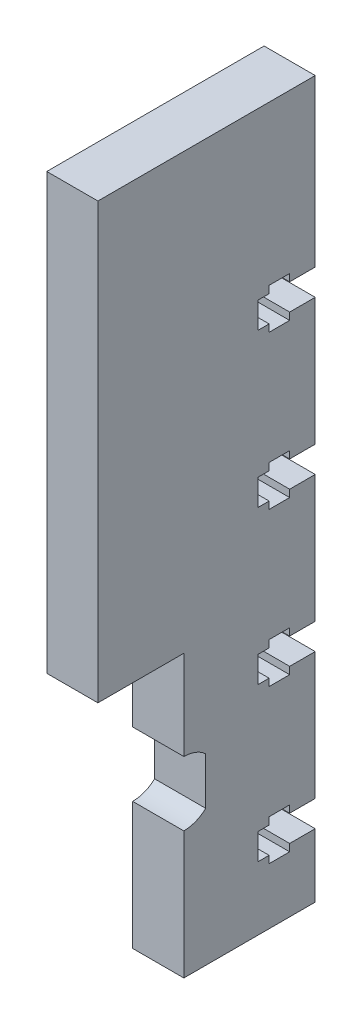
ISO-10303-21;
HEADER;
FILE_DESCRIPTION(('STEP AP214'),'2;1');
FILE_NAME('part.step','',(''),(''),'','','');
FILE_SCHEMA(('AUTOMOTIVE_DESIGN { 1 0 10303 214 1 1 1 1 }'));
ENDSEC;
DATA;
#1=APPLICATION_CONTEXT('core data for automotive mechanical design processes');
#2=APPLICATION_PROTOCOL_DEFINITION('international standard','automotive_design',2000,#1);
#3=PRODUCT_CONTEXT('',#1,'mechanical');
#4=PRODUCT('Part','Part','',(#3));
#5=PRODUCT_RELATED_PRODUCT_CATEGORY('part','',(#4));
#6=PRODUCT_DEFINITION_FORMATION('','',#4);
#7=PRODUCT_DEFINITION_CONTEXT('part definition',#1,'design');
#8=PRODUCT_DEFINITION('design','',#6,#7);
#9=PRODUCT_DEFINITION_SHAPE('','',#8);
#10=(LENGTH_UNIT() NAMED_UNIT(*) SI_UNIT(.MILLI.,.METRE.));
#11=(NAMED_UNIT(*) PLANE_ANGLE_UNIT() SI_UNIT($,.RADIAN.));
#12=(NAMED_UNIT(*) SI_UNIT($,.STERADIAN.) SOLID_ANGLE_UNIT());
#13=UNCERTAINTY_MEASURE_WITH_UNIT(LENGTH_MEASURE(1.E-05),#10,'distance_accuracy_value','');
#14=(GEOMETRIC_REPRESENTATION_CONTEXT(3) GLOBAL_UNCERTAINTY_ASSIGNED_CONTEXT((#13)) GLOBAL_UNIT_ASSIGNED_CONTEXT((#10,
#11,#12)) REPRESENTATION_CONTEXT('',''));
#15=CARTESIAN_POINT('',(0.,0.,0.));
#16=DIRECTION('',(0.,0.,1.));
#17=DIRECTION('',(1.,0.,0.));
#18=AXIS2_PLACEMENT_3D('',#15,#16,#17);
#19=CARTESIAN_POINT('',(0.,0.,0.));
#20=DIRECTION('',(0.,0.,-1.));
#21=DIRECTION('',(-1.,0.,0.));
#22=AXIS2_PLACEMENT_3D('',#19,#20,#21);
#23=PLANE('',#22);
#24=DIRECTION('',(0.,-1.,0.));
#25=VECTOR('',#24,1.);
#26=CARTESIAN_POINT('',(-45.710000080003,0.,0.));
#27=LINE('',#26,#25);
#28=CARTESIAN_POINT('',(-45.710000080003,15.8,0.));
#29=VERTEX_POINT('',#28);
#30=CARTESIAN_POINT('',(-45.710000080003,0.,0.));
#31=VERTEX_POINT('',#30);
#32=EDGE_CURVE('E788',#29,#31,#27,.T.);
#33=ORIENTED_EDGE('',*,*,#32,.F.);
#34=DIRECTION('',(1.,0.,0.));
#35=VECTOR('',#34,1.);
#36=CARTESIAN_POINT('',(-45.710000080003,15.8,0.));
#37=LINE('',#36,#35);
#38=CARTESIAN_POINT('',(-33.010000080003,15.8,0.));
#39=VERTEX_POINT('',#38);
#40=EDGE_CURVE('E478',#29,#39,#37,.T.);
#41=ORIENTED_EDGE('',*,*,#40,.T.);
#42=DIRECTION('',(0.,1.,0.));
#43=VECTOR('',#42,1.);
#44=CARTESIAN_POINT('',(-33.010000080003,0.,0.));
#45=LINE('',#44,#43);
#46=CARTESIAN_POINT('',(-33.010000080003,0.,0.));
#47=VERTEX_POINT('',#46);
#48=EDGE_CURVE('E818',#47,#39,#45,.T.);
#49=ORIENTED_EDGE('',*,*,#48,.F.);
#50=DIRECTION('',(1.,0.,0.));
#51=VECTOR('',#50,1.);
#52=CARTESIAN_POINT('',(-45.710000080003,0.,0.));
#53=LINE('',#52,#51);
#54=EDGE_CURVE('E812',#31,#47,#53,.T.);
#55=ORIENTED_EDGE('',*,*,#54,.F.);
#56=EDGE_LOOP('',(#33,#41,#49,#55));
#57=FACE_BOUND('',#56,.T.);
#58=ADVANCED_FACE('F35',(#57),#23,.T.);
#59=DIRECTION('',(1.,0.,0.));
#60=VECTOR('',#59,1.);
#61=CARTESIAN_POINT('',(-45.710000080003,22.3,0.));
#62=LINE('',#61,#60);
#63=CARTESIAN_POINT('',(-45.710000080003,22.3,0.));
#64=VERTEX_POINT('',#63);
#65=CARTESIAN_POINT('',(-33.010000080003,22.3,0.));
#66=VERTEX_POINT('',#65);
#67=EDGE_CURVE('E476',#64,#66,#62,.T.);
#68=ORIENTED_EDGE('',*,*,#67,.F.);
#69=CARTESIAN_POINT('',(-45.710000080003,53.9,0.));
#70=VERTEX_POINT('',#69);
#71=EDGE_CURVE('E966',#70,#64,#27,.T.);
#72=ORIENTED_EDGE('',*,*,#71,.F.);
#73=DIRECTION('',(1.,0.,0.));
#74=VECTOR('',#73,1.);
#75=CARTESIAN_POINT('',(-45.710000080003,53.9,0.));
#76=LINE('',#75,#74);
#77=CARTESIAN_POINT('',(-33.010000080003,53.9,0.));
#78=VERTEX_POINT('',#77);
#79=EDGE_CURVE('E561',#70,#78,#76,.T.);
#80=ORIENTED_EDGE('',*,*,#79,.T.);
#81=EDGE_CURVE('E821',#66,#78,#45,.T.);
#82=ORIENTED_EDGE('',*,*,#81,.F.);
#83=EDGE_LOOP('',(#68,#72,#80,#82));
#84=FACE_BOUND('',#83,.T.);
#85=ADVANCED_FACE('F882',(#84),#23,.T.);
#86=CARTESIAN_POINT('',(-45.710000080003,130.1,0.));
#87=VERTEX_POINT('',#86);
#88=CARTESIAN_POINT('',(-45.710000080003,98.5,0.));
#89=VERTEX_POINT('',#88);
#90=EDGE_CURVE('E813',#87,#89,#27,.T.);
#91=ORIENTED_EDGE('',*,*,#90,.F.);
#92=DIRECTION('',(1.,0.,0.));
#93=VECTOR('',#92,1.);
#94=CARTESIAN_POINT('',(-45.710000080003,130.1,0.));
#95=LINE('',#94,#93);
#96=CARTESIAN_POINT('',(-33.010000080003,130.1,0.));
#97=VERTEX_POINT('',#96);
#98=EDGE_CURVE('E660',#87,#97,#95,.T.);
#99=ORIENTED_EDGE('',*,*,#98,.T.);
#100=CARTESIAN_POINT('',(-33.010000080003,98.5,0.));
#101=VERTEX_POINT('',#100);
#102=EDGE_CURVE('E822',#101,#97,#45,.T.);
#103=ORIENTED_EDGE('',*,*,#102,.F.);
#104=DIRECTION('',(1.,0.,0.));
#105=VECTOR('',#104,1.);
#106=CARTESIAN_POINT('',(-45.710000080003,98.5,0.));
#107=LINE('',#106,#105);
#108=EDGE_CURVE('E732',#89,#101,#107,.T.);
#109=ORIENTED_EDGE('',*,*,#108,.F.);
#110=EDGE_LOOP('',(#91,#99,#103,#109));
#111=FACE_BOUND('',#110,.T.);
#112=ADVANCED_FACE('F944',(#111),#23,.T.);
#113=DIRECTION('',(1.,0.,0.));
#114=VECTOR('',#113,1.);
#115=CARTESIAN_POINT('',(-45.710000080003,60.4,0.));
#116=LINE('',#115,#114);
#117=CARTESIAN_POINT('',(-45.710000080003,60.4,0.));
#118=VERTEX_POINT('',#117);
#119=CARTESIAN_POINT('',(-33.010000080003,60.4,0.));
#120=VERTEX_POINT('',#119);
#121=EDGE_CURVE('E559',#118,#120,#116,.T.);
#122=ORIENTED_EDGE('',*,*,#121,.F.);
#123=CARTESIAN_POINT('',(-45.710000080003,92.,0.));
#124=VERTEX_POINT('',#123);
#125=EDGE_CURVE('E814',#124,#118,#27,.T.);
#126=ORIENTED_EDGE('',*,*,#125,.F.);
#127=DIRECTION('',(1.,0.,0.));
#128=VECTOR('',#127,1.);
#129=CARTESIAN_POINT('',(-45.710000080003,92.,0.));
#130=LINE('',#129,#128);
#131=CARTESIAN_POINT('',(-33.010000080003,92.,0.));
#132=VERTEX_POINT('',#131);
#133=EDGE_CURVE('E734',#124,#132,#130,.T.);
#134=ORIENTED_EDGE('',*,*,#133,.T.);
#135=EDGE_CURVE('E884',#120,#132,#45,.T.);
#136=ORIENTED_EDGE('',*,*,#135,.F.);
#137=EDGE_LOOP('',(#122,#126,#134,#136));
#138=FACE_BOUND('',#137,.T.);
#139=ADVANCED_FACE('F947',(#138),#23,.T.);
#140=CARTESIAN_POINT('',(-45.710000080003,0.,53.975));
#141=DIRECTION('',(1.,0.,0.));
#142=DIRECTION('',(0.,0.,-1.));
#143=AXIS2_PLACEMENT_3D('',#140,#141,#142);
#144=PLANE('',#143);
#145=ORIENTED_EDGE('',*,*,#71,.T.);
#146=DIRECTION('',(0.,0.,1.));
#147=VECTOR('',#146,1.);
#148=CARTESIAN_POINT('',(-45.710000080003,22.3,0.));
#149=LINE('',#148,#147);
#150=CARTESIAN_POINT('',(-45.710000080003,22.3,6.3499999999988));
#151=VERTEX_POINT('',#150);
#152=EDGE_CURVE('E438',#64,#151,#149,.T.);
#153=ORIENTED_EDGE('',*,*,#152,.T.);
#154=DIRECTION('',(0.,1.,0.));
#155=VECTOR('',#154,1.);
#156=CARTESIAN_POINT('',(-45.710000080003,0.,6.3499999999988));
#157=LINE('',#156,#155);
#158=CARTESIAN_POINT('',(-45.710000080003,24.1,6.3499999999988));
#159=VERTEX_POINT('',#158);
#160=EDGE_CURVE('E441',#151,#159,#157,.T.);
#161=ORIENTED_EDGE('',*,*,#160,.T.);
#162=DIRECTION('',(0.,0.,1.));
#163=VECTOR('',#162,1.);
#164=CARTESIAN_POINT('',(-45.710000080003,24.1,0.));
#165=LINE('',#164,#163);
#166=CARTESIAN_POINT('',(-45.710000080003,24.1,11.4499999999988));
#167=VERTEX_POINT('',#166);
#168=EDGE_CURVE('E408',#159,#167,#165,.T.);
#169=ORIENTED_EDGE('',*,*,#168,.T.);
#170=DIRECTION('',(0.,-1.,0.));
#171=VECTOR('',#170,1.);
#172=CARTESIAN_POINT('',(-45.710000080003,0.,11.4499999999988));
#173=LINE('',#172,#171);
#174=CARTESIAN_POINT('',(-45.710000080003,22.3,11.4499999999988));
#175=VERTEX_POINT('',#174);
#176=EDGE_CURVE('E402',#167,#175,#173,.T.);
#177=ORIENTED_EDGE('',*,*,#176,.T.);
#178=DIRECTION('',(0.,0.,1.));
#179=VECTOR('',#178,1.);
#180=CARTESIAN_POINT('',(-45.710000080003,22.2999999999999,-2.23125211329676E-13));
#181=LINE('',#180,#179);
#182=CARTESIAN_POINT('',(-45.710000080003,22.3,14.2239999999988));
#183=VERTEX_POINT('',#182);
#184=EDGE_CURVE('E411',#175,#183,#181,.T.);
#185=ORIENTED_EDGE('',*,*,#184,.T.);
#186=DIRECTION('',(0.,-1.,0.));
#187=VECTOR('',#186,1.);
#188=CARTESIAN_POINT('',(-45.710000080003,0.,14.2239999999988));
#189=LINE('',#188,#187);
#190=CARTESIAN_POINT('',(-45.710000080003,15.8,14.2239999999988));
#191=VERTEX_POINT('',#190);
#192=EDGE_CURVE('E416',#183,#191,#189,.T.);
#193=ORIENTED_EDGE('',*,*,#192,.T.);
#194=DIRECTION('',(0.,0.,1.));
#195=VECTOR('',#194,1.);
#196=CARTESIAN_POINT('',(-45.710000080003,15.8000000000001,1.58088714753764E-13));
#197=LINE('',#196,#195);
#198=CARTESIAN_POINT('',(-45.710000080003,15.8,11.4499999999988));
#199=VERTEX_POINT('',#198);
#200=EDGE_CURVE('E428',#199,#191,#197,.T.);
#201=ORIENTED_EDGE('',*,*,#200,.F.);
#202=DIRECTION('',(0.,1.,0.));
#203=VECTOR('',#202,1.);
#204=CARTESIAN_POINT('',(-45.710000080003,0.,11.4499999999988));
#205=LINE('',#204,#203);
#206=CARTESIAN_POINT('',(-45.710000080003,14.,11.4499999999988));
#207=VERTEX_POINT('',#206);
#208=EDGE_CURVE('E430',#207,#199,#205,.T.);
#209=ORIENTED_EDGE('',*,*,#208,.F.);
#210=DIRECTION('',(0.,0.,1.));
#211=VECTOR('',#210,1.);
#212=CARTESIAN_POINT('',(-45.710000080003,14.,0.));
#213=LINE('',#212,#211);
#214=CARTESIAN_POINT('',(-45.710000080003,14.,6.3499999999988));
#215=VERTEX_POINT('',#214);
#216=EDGE_CURVE('E432',#215,#207,#213,.T.);
#217=ORIENTED_EDGE('',*,*,#216,.F.);
#218=DIRECTION('',(0.,-1.,0.));
#219=VECTOR('',#218,1.);
#220=CARTESIAN_POINT('',(-45.710000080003,0.,6.3499999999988));
#221=LINE('',#220,#219);
#222=CARTESIAN_POINT('',(-45.710000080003,15.8,6.3499999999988));
#223=VERTEX_POINT('',#222);
#224=EDGE_CURVE('E434',#223,#215,#221,.T.);
#225=ORIENTED_EDGE('',*,*,#224,.F.);
#226=DIRECTION('',(0.,0.,1.));
#227=VECTOR('',#226,1.);
#228=CARTESIAN_POINT('',(-45.710000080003,15.8,0.));
#229=LINE('',#228,#227);
#230=EDGE_CURVE('E436',#29,#223,#229,.T.);
#231=ORIENTED_EDGE('',*,*,#230,.F.);
#232=ORIENTED_EDGE('',*,*,#32,.T.);
#233=DIRECTION('',(0.,0.,-1.));
#234=VECTOR('',#233,1.);
#235=CARTESIAN_POINT('',(-45.710000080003,0.,53.975));
#236=LINE('',#235,#234);
#237=CARTESIAN_POINT('',(-45.710000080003,0.,32.6353617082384));
#238=VERTEX_POINT('',#237);
#239=EDGE_CURVE('E11',#238,#31,#236,.T.);
#240=ORIENTED_EDGE('',*,*,#239,.F.);
#241=DIRECTION('',(0.,1.,0.));
#242=VECTOR('',#241,1.);
#243=CARTESIAN_POINT('',(-45.710000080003,31.6389802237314,32.6353617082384));
#244=LINE('',#243,#242);
#245=CARTESIAN_POINT('',(-45.710000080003,31.6389802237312,32.6353617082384));
#246=VERTEX_POINT('',#245);
#247=EDGE_CURVE('E750',#238,#246,#244,.T.);
#248=ORIENTED_EDGE('',*,*,#247,.T.);
#249=CARTESIAN_POINT('',(-45.710000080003,39.638980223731,32.6353617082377));
#250=DIRECTION('',(1.,0.,0.));
#251=DIRECTION('',(0.,0.,1.));
#252=AXIS2_PLACEMENT_3D('',#249,#250,#251);
#253=CIRCLE('',#252,7.99999999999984);
#254=CARTESIAN_POINT('',(-45.710000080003,33.7732833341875,27.1953617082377));
#255=VERTEX_POINT('',#254);
#256=EDGE_CURVE('E753',#246,#255,#253,.T.);
#257=ORIENTED_EDGE('',*,*,#256,.T.);
#258=DIRECTION('',(0.,1.,0.));
#259=VECTOR('',#258,1.);
#260=CARTESIAN_POINT('',(-45.710000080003,45.5046771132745,27.1953617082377));
#261=LINE('',#260,#259);
#262=CARTESIAN_POINT('',(-45.710000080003,45.5046771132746,27.1953617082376));
#263=VERTEX_POINT('',#262);
#264=EDGE_CURVE('E757',#255,#263,#261,.T.);
#265=ORIENTED_EDGE('',*,*,#264,.T.);
#266=CARTESIAN_POINT('',(-45.710000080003,39.638980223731,32.6353617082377));
#267=DIRECTION('',(1.,0.,0.));
#268=DIRECTION('',(0.,0.,-1.));
#269=AXIS2_PLACEMENT_3D('',#266,#267,#268);
#270=CIRCLE('',#269,8.00000000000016);
#271=CARTESIAN_POINT('',(-45.710000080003,47.6389802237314,32.6353617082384));
#272=VERTEX_POINT('',#271);
#273=EDGE_CURVE('E760',#263,#272,#270,.T.);
#274=ORIENTED_EDGE('',*,*,#273,.T.);
#275=DIRECTION('',(0.,1.,0.));
#276=VECTOR('',#275,1.);
#277=CARTESIAN_POINT('',(-45.710000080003,69.8500000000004,32.6353617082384));
#278=LINE('',#277,#276);
#279=CARTESIAN_POINT('',(-45.710000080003,69.8500000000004,32.6353617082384));
#280=VERTEX_POINT('',#279);
#281=EDGE_CURVE('E763',#272,#280,#278,.T.);
#282=ORIENTED_EDGE('',*,*,#281,.T.);
#283=DIRECTION('',(0.,0.,1.));
#284=VECTOR('',#283,1.);
#285=CARTESIAN_POINT('',(-45.710000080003,69.8500000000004,53.975));
#286=LINE('',#285,#284);
#287=CARTESIAN_POINT('',(-45.710000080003,69.8500000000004,53.975));
#288=VERTEX_POINT('',#287);
#289=EDGE_CURVE('E766',#280,#288,#286,.T.);
#290=ORIENTED_EDGE('',*,*,#289,.T.);
#291=DIRECTION('',(0.,-1.,0.));
#292=VECTOR('',#291,1.);
#293=CARTESIAN_POINT('',(-45.710000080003,0.,53.975));
#294=LINE('',#293,#292);
#295=CARTESIAN_POINT('',(-45.710000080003,177.8,53.975));
#296=VERTEX_POINT('',#295);
#297=EDGE_CURVE('E800',#296,#288,#294,.T.);
#298=ORIENTED_EDGE('',*,*,#297,.F.);
#299=DIRECTION('',(0.,0.,-1.));
#300=VECTOR('',#299,1.);
#301=CARTESIAN_POINT('',(-45.710000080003,177.8,53.975));
#302=LINE('',#301,#300);
#303=CARTESIAN_POINT('',(-45.710000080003,177.8,0.));
#304=VERTEX_POINT('',#303);
#305=EDGE_CURVE('E808',#296,#304,#302,.T.);
#306=ORIENTED_EDGE('',*,*,#305,.T.);
#307=CARTESIAN_POINT('',(-45.710000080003,136.6,0.));
#308=VERTEX_POINT('',#307);
#309=EDGE_CURVE('E809',#304,#308,#27,.T.);
#310=ORIENTED_EDGE('',*,*,#309,.T.);
#311=DIRECTION('',(0.,0.,1.));
#312=VECTOR('',#311,1.);
#313=CARTESIAN_POINT('',(-45.710000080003,136.6,0.));
#314=LINE('',#313,#312);
#315=CARTESIAN_POINT('',(-45.710000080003,136.6,6.35));
#316=VERTEX_POINT('',#315);
#317=EDGE_CURVE('E582',#308,#316,#314,.T.);
#318=ORIENTED_EDGE('',*,*,#317,.T.);
#319=DIRECTION('',(0.,1.,0.));
#320=VECTOR('',#319,1.);
#321=CARTESIAN_POINT('',(-45.710000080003,0.,6.35));
#322=LINE('',#321,#320);
#323=CARTESIAN_POINT('',(-45.710000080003,138.4,6.35));
#324=VERTEX_POINT('',#323);
#325=EDGE_CURVE('E585',#316,#324,#322,.T.);
#326=ORIENTED_EDGE('',*,*,#325,.T.);
#327=DIRECTION('',(0.,0.,1.));
#328=VECTOR('',#327,1.);
#329=CARTESIAN_POINT('',(-45.710000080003,138.4,0.));
#330=LINE('',#329,#328);
#331=CARTESIAN_POINT('',(-45.710000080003,138.4,11.45));
#332=VERTEX_POINT('',#331);
#333=EDGE_CURVE('E588',#324,#332,#330,.T.);
#334=ORIENTED_EDGE('',*,*,#333,.T.);
#335=DIRECTION('',(0.,-1.,0.));
#336=VECTOR('',#335,1.);
#337=CARTESIAN_POINT('',(-45.710000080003,0.,11.45));
#338=LINE('',#337,#336);
#339=CARTESIAN_POINT('',(-45.710000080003,136.6,11.45));
#340=VERTEX_POINT('',#339);
#341=EDGE_CURVE('E591',#332,#340,#338,.T.);
#342=ORIENTED_EDGE('',*,*,#341,.T.);
#343=DIRECTION('',(0.,0.,1.));
#344=VECTOR('',#343,1.);
#345=CARTESIAN_POINT('',(-45.710000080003,136.6,-1.36676698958E-12));
#346=LINE('',#345,#344);
#347=CARTESIAN_POINT('',(-45.710000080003,136.6,14.224));
#348=VERTEX_POINT('',#347);
#349=EDGE_CURVE('E594',#340,#348,#346,.T.);
#350=ORIENTED_EDGE('',*,*,#349,.T.);
#351=DIRECTION('',(0.,-1.,0.));
#352=VECTOR('',#351,1.);
#353=CARTESIAN_POINT('',(-45.710000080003,0.,14.224));
#354=LINE('',#353,#352);
#355=CARTESIAN_POINT('',(-45.710000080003,130.1,14.224));
#356=VERTEX_POINT('',#355);
#357=EDGE_CURVE('E597',#348,#356,#354,.T.);
#358=ORIENTED_EDGE('',*,*,#357,.T.);
#359=DIRECTION('',(0.,0.,1.));
#360=VECTOR('',#359,1.);
#361=CARTESIAN_POINT('',(-45.710000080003,130.1,1.30173049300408E-12));
#362=LINE('',#361,#360);
#363=CARTESIAN_POINT('',(-45.710000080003,130.1,11.45));
#364=VERTEX_POINT('',#363);
#365=EDGE_CURVE('E600',#364,#356,#362,.T.);
#366=ORIENTED_EDGE('',*,*,#365,.F.);
#367=DIRECTION('',(0.,1.,0.));
#368=VECTOR('',#367,1.);
#369=CARTESIAN_POINT('',(-45.710000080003,0.,11.4499999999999));
#370=LINE('',#369,#368);
#371=CARTESIAN_POINT('',(-45.710000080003,128.3,11.45));
#372=VERTEX_POINT('',#371);
#373=EDGE_CURVE('E602',#372,#364,#370,.T.);
#374=ORIENTED_EDGE('',*,*,#373,.F.);
#375=DIRECTION('',(0.,0.,1.));
#376=VECTOR('',#375,1.);
#377=CARTESIAN_POINT('',(-45.710000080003,128.3,0.));
#378=LINE('',#377,#376);
#379=CARTESIAN_POINT('',(-45.710000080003,128.3,6.35));
#380=VERTEX_POINT('',#379);
#381=EDGE_CURVE('E604',#380,#372,#378,.T.);
#382=ORIENTED_EDGE('',*,*,#381,.F.);
#383=DIRECTION('',(0.,-1.,0.));
#384=VECTOR('',#383,1.);
#385=CARTESIAN_POINT('',(-45.710000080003,0.,6.35));
#386=LINE('',#385,#384);
#387=CARTESIAN_POINT('',(-45.710000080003,130.1,6.35));
#388=VERTEX_POINT('',#387);
#389=EDGE_CURVE('E577',#388,#380,#386,.T.);
#390=ORIENTED_EDGE('',*,*,#389,.F.);
#391=DIRECTION('',(0.,0.,1.));
#392=VECTOR('',#391,1.);
#393=CARTESIAN_POINT('',(-45.710000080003,130.1,0.));
#394=LINE('',#393,#392);
#395=EDGE_CURVE('E579',#87,#388,#394,.T.);
#396=ORIENTED_EDGE('',*,*,#395,.F.);
#397=ORIENTED_EDGE('',*,*,#90,.T.);
#398=DIRECTION('',(0.,0.,1.));
#399=VECTOR('',#398,1.);
#400=CARTESIAN_POINT('',(-45.710000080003,98.5,0.));
#401=LINE('',#400,#399);
#402=CARTESIAN_POINT('',(-45.710000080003,98.5,6.3499999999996));
#403=VERTEX_POINT('',#402);
#404=EDGE_CURVE('E684',#89,#403,#401,.T.);
#405=ORIENTED_EDGE('',*,*,#404,.T.);
#406=DIRECTION('',(0.,1.,0.));
#407=VECTOR('',#406,1.);
#408=CARTESIAN_POINT('',(-45.710000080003,0.,6.3499999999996));
#409=LINE('',#408,#407);
#410=CARTESIAN_POINT('',(-45.710000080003,100.3,6.3499999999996));
#411=VERTEX_POINT('',#410);
#412=EDGE_CURVE('E687',#403,#411,#409,.T.);
#413=ORIENTED_EDGE('',*,*,#412,.T.);
#414=DIRECTION('',(0.,0.,1.));
#415=VECTOR('',#414,1.);
#416=CARTESIAN_POINT('',(-45.710000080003,100.3,0.));
#417=LINE('',#416,#415);
#418=CARTESIAN_POINT('',(-45.710000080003,100.3,11.4499999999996));
#419=VERTEX_POINT('',#418);
#420=EDGE_CURVE('E690',#411,#419,#417,.T.);
#421=ORIENTED_EDGE('',*,*,#420,.T.);
#422=DIRECTION('',(0.,-1.,0.));
#423=VECTOR('',#422,1.);
#424=CARTESIAN_POINT('',(-45.710000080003,0.,11.4499999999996));
#425=LINE('',#424,#423);
#426=CARTESIAN_POINT('',(-45.710000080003,98.5,11.4499999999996));
#427=VERTEX_POINT('',#426);
#428=EDGE_CURVE('E664',#419,#427,#425,.T.);
#429=ORIENTED_EDGE('',*,*,#428,.T.);
#430=DIRECTION('',(0.,0.,1.));
#431=VECTOR('',#430,1.);
#432=CARTESIAN_POINT('',(-45.710000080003,98.4999999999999,-9.85553063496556E-13));
#433=LINE('',#432,#431);
#434=CARTESIAN_POINT('',(-45.710000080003,98.5000000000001,14.2239999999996));
#435=VERTEX_POINT('',#434);
#436=EDGE_CURVE('E667',#427,#435,#433,.T.);
#437=ORIENTED_EDGE('',*,*,#436,.T.);
#438=DIRECTION('',(0.,-1.,0.));
#439=VECTOR('',#438,1.);
#440=CARTESIAN_POINT('',(-45.710000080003,0.,14.2239999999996));
#441=LINE('',#440,#439);
#442=CARTESIAN_POINT('',(-45.710000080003,92.,14.2239999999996));
#443=VERTEX_POINT('',#442);
#444=EDGE_CURVE('E671',#435,#443,#441,.T.);
#445=ORIENTED_EDGE('',*,*,#444,.T.);
#446=DIRECTION('',(0.,0.,1.));
#447=VECTOR('',#446,1.);
#448=CARTESIAN_POINT('',(-45.710000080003,92.0000000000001,9.20516566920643E-13));
#449=LINE('',#448,#447);
#450=CARTESIAN_POINT('',(-45.710000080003,92.,11.4499999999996));
#451=VERTEX_POINT('',#450);
#452=EDGE_CURVE('E674',#451,#443,#449,.T.);
#453=ORIENTED_EDGE('',*,*,#452,.F.);
#454=DIRECTION('',(0.,1.,0.));
#455=VECTOR('',#454,1.);
#456=CARTESIAN_POINT('',(-45.710000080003,0.,11.4499999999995));
#457=LINE('',#456,#455);
#458=CARTESIAN_POINT('',(-45.710000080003,90.2,11.4499999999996));
#459=VERTEX_POINT('',#458);
#460=EDGE_CURVE('E676',#459,#451,#457,.T.);
#461=ORIENTED_EDGE('',*,*,#460,.F.);
#462=DIRECTION('',(0.,0.,1.));
#463=VECTOR('',#462,1.);
#464=CARTESIAN_POINT('',(-45.710000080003,90.2,0.));
#465=LINE('',#464,#463);
#466=CARTESIAN_POINT('',(-45.710000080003,90.2,6.3499999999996));
#467=VERTEX_POINT('',#466);
#468=EDGE_CURVE('E678',#467,#459,#465,.T.);
#469=ORIENTED_EDGE('',*,*,#468,.F.);
#470=DIRECTION('',(0.,-1.,0.));
#471=VECTOR('',#470,1.);
#472=CARTESIAN_POINT('',(-45.710000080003,0.,6.3499999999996));
#473=LINE('',#472,#471);
#474=CARTESIAN_POINT('',(-45.710000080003,92.,6.3499999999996));
#475=VERTEX_POINT('',#474);
#476=EDGE_CURVE('E680',#475,#467,#473,.T.);
#477=ORIENTED_EDGE('',*,*,#476,.F.);
#478=DIRECTION('',(0.,0.,1.));
#479=VECTOR('',#478,1.);
#480=CARTESIAN_POINT('',(-45.710000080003,92.,0.));
#481=LINE('',#480,#479);
#482=EDGE_CURVE('E682',#124,#475,#481,.T.);
#483=ORIENTED_EDGE('',*,*,#482,.F.);
#484=ORIENTED_EDGE('',*,*,#125,.T.);
#485=DIRECTION('',(0.,0.,1.));
#486=VECTOR('',#485,1.);
#487=CARTESIAN_POINT('',(-45.710000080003,60.4,0.));
#488=LINE('',#487,#486);
#489=CARTESIAN_POINT('',(-45.710000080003,60.4,6.3499999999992));
#490=VERTEX_POINT('',#489);
#491=EDGE_CURVE('E512',#118,#490,#488,.T.);
#492=ORIENTED_EDGE('',*,*,#491,.T.);
#493=DIRECTION('',(0.,1.,0.));
#494=VECTOR('',#493,1.);
#495=CARTESIAN_POINT('',(-45.710000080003,0.,6.3499999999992));
#496=LINE('',#495,#494);
#497=CARTESIAN_POINT('',(-45.710000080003,62.2,6.3499999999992));
#498=VERTEX_POINT('',#497);
#499=EDGE_CURVE('E515',#490,#498,#496,.T.);
#500=ORIENTED_EDGE('',*,*,#499,.T.);
#501=DIRECTION('',(0.,0.,1.));
#502=VECTOR('',#501,1.);
#503=CARTESIAN_POINT('',(-45.710000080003,62.2,0.));
#504=LINE('',#503,#502);
#505=CARTESIAN_POINT('',(-45.710000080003,62.2,11.4499999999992));
#506=VERTEX_POINT('',#505);
#507=EDGE_CURVE('E518',#498,#506,#504,.T.);
#508=ORIENTED_EDGE('',*,*,#507,.T.);
#509=DIRECTION('',(0.,-1.,0.));
#510=VECTOR('',#509,1.);
#511=CARTESIAN_POINT('',(-45.710000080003,0.,11.4499999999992));
#512=LINE('',#511,#510);
#513=CARTESIAN_POINT('',(-45.710000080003,60.4,11.4499999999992));
#514=VERTEX_POINT('',#513);
#515=EDGE_CURVE('E492',#506,#514,#512,.T.);
#516=ORIENTED_EDGE('',*,*,#515,.T.);
#517=DIRECTION('',(0.,0.,1.));
#518=VECTOR('',#517,1.);
#519=CARTESIAN_POINT('',(-45.710000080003,60.3999999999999,-6.04339137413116E-13));
#520=LINE('',#519,#518);
#521=CARTESIAN_POINT('',(-45.710000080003,60.4,14.2239999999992));
#522=VERTEX_POINT('',#521);
#523=EDGE_CURVE('E495',#514,#522,#520,.T.);
#524=ORIENTED_EDGE('',*,*,#523,.T.);
#525=DIRECTION('',(0.,-1.,0.));
#526=VECTOR('',#525,1.);
#527=CARTESIAN_POINT('',(-45.710000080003,0.,14.2239999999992));
#528=LINE('',#527,#526);
#529=CARTESIAN_POINT('',(-45.710000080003,53.9,14.2239999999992));
#530=VERTEX_POINT('',#529);
#531=EDGE_CURVE('E499',#522,#530,#528,.T.);
#532=ORIENTED_EDGE('',*,*,#531,.T.);
#533=DIRECTION('',(0.,0.,1.));
#534=VECTOR('',#533,1.);
#535=CARTESIAN_POINT('',(-45.710000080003,53.9000000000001,5.39302640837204E-13));
#536=LINE('',#535,#534);
#537=CARTESIAN_POINT('',(-45.710000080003,53.9,11.4499999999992));
#538=VERTEX_POINT('',#537);
#539=EDGE_CURVE('E502',#538,#530,#536,.T.);
#540=ORIENTED_EDGE('',*,*,#539,.F.);
#541=DIRECTION('',(0.,1.,0.));
#542=VECTOR('',#541,1.);
#543=CARTESIAN_POINT('',(-45.710000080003,0.,11.4499999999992));
#544=LINE('',#543,#542);
#545=CARTESIAN_POINT('',(-45.710000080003,52.1,11.4499999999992));
#546=VERTEX_POINT('',#545);
#547=EDGE_CURVE('E504',#546,#538,#544,.T.);
#548=ORIENTED_EDGE('',*,*,#547,.F.);
#549=DIRECTION('',(0.,0.,1.));
#550=VECTOR('',#549,1.);
#551=CARTESIAN_POINT('',(-45.710000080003,52.1,0.));
#552=LINE('',#551,#550);
#553=CARTESIAN_POINT('',(-45.710000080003,52.1,6.3499999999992));
#554=VERTEX_POINT('',#553);
#555=EDGE_CURVE('E506',#554,#546,#552,.T.);
#556=ORIENTED_EDGE('',*,*,#555,.F.);
#557=DIRECTION('',(0.,-1.,0.));
#558=VECTOR('',#557,1.);
#559=CARTESIAN_POINT('',(-45.710000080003,0.,6.3499999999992));
#560=LINE('',#559,#558);
#561=CARTESIAN_POINT('',(-45.710000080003,53.9,6.3499999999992));
#562=VERTEX_POINT('',#561);
#563=EDGE_CURVE('E508',#562,#554,#560,.T.);
#564=ORIENTED_EDGE('',*,*,#563,.F.);
#565=DIRECTION('',(0.,0.,1.));
#566=VECTOR('',#565,1.);
#567=CARTESIAN_POINT('',(-45.710000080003,53.9,0.));
#568=LINE('',#567,#566);
#569=EDGE_CURVE('E510',#70,#562,#568,.T.);
#570=ORIENTED_EDGE('',*,*,#569,.F.);
#571=EDGE_LOOP('',(#145,#153,#161,#169,#177,#185,#193,#201,#209,#217,#225,#231,#232,#240,#248,
#257,#265,#274,#282,#290,#298,#306,#310,#318,#326,#334,#342,#350,#358,#366,#374,#382,#390,#396,
#397,#405,#413,#421,#429,#437,#445,#453,#461,#469,#477,#483,#484,#492,#500,#508,#516,#524,#532,
#540,#548,#556,#564,#570));
#572=FACE_BOUND('',#571,.T.);
#573=ADVANCED_FACE('F37',(#572),#144,.F.);
#574=CARTESIAN_POINT('',(-45.710000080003,0.,53.975));
#575=DIRECTION('',(0.,1.,0.));
#576=DIRECTION('',(0.,0.,1.));
#577=AXIS2_PLACEMENT_3D('',#574,#575,#576);
#578=PLANE('',#577);
#579=DIRECTION('',(0.,0.,-1.));
#580=VECTOR('',#579,1.);
#581=CARTESIAN_POINT('',(-33.010000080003,0.,53.975));
#582=LINE('',#581,#580);
#583=CARTESIAN_POINT('',(-33.010000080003,0.,32.6353617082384));
#584=VERTEX_POINT('',#583);
#585=EDGE_CURVE('E43',#584,#47,#582,.T.);
#586=ORIENTED_EDGE('',*,*,#585,.F.);
#587=DIRECTION('',(1.,0.,0.));
#588=VECTOR('',#587,1.);
#589=CARTESIAN_POINT('',(-45.710000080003,0.,32.6353617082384));
#590=LINE('',#589,#588);
#591=EDGE_CURVE('E769',#238,#584,#590,.T.);
#592=ORIENTED_EDGE('',*,*,#591,.F.);
#593=ORIENTED_EDGE('',*,*,#239,.T.);
#594=ORIENTED_EDGE('',*,*,#54,.T.);
#595=EDGE_LOOP('',(#586,#592,#593,#594));
#596=FACE_BOUND('',#595,.T.);
#597=ADVANCED_FACE('F838',(#596),#578,.F.);
#598=CARTESIAN_POINT('',(-33.010000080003,0.,53.975));
#599=DIRECTION('',(-1.,0.,0.));
#600=DIRECTION('',(0.,0.,1.));
#601=AXIS2_PLACEMENT_3D('',#598,#599,#600);
#602=PLANE('',#601);
#603=DIRECTION('',(0.,1.,0.));
#604=VECTOR('',#603,1.);
#605=CARTESIAN_POINT('',(-33.010000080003,0.,6.3499999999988));
#606=LINE('',#605,#604);
#607=CARTESIAN_POINT('',(-33.010000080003,22.3,6.3499999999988));
#608=VERTEX_POINT('',#607);
#609=CARTESIAN_POINT('',(-33.010000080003,24.1,6.3499999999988));
#610=VERTEX_POINT('',#609);
#611=EDGE_CURVE('E424',#608,#610,#606,.T.);
#612=ORIENTED_EDGE('',*,*,#611,.F.);
#613=DIRECTION('',(0.,0.,1.));
#614=VECTOR('',#613,1.);
#615=CARTESIAN_POINT('',(-33.010000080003,22.3,0.));
#616=LINE('',#615,#614);
#617=EDGE_CURVE('E465',#66,#608,#616,.T.);
#618=ORIENTED_EDGE('',*,*,#617,.F.);
#619=ORIENTED_EDGE('',*,*,#81,.T.);
#620=DIRECTION('',(0.,0.,1.));
#621=VECTOR('',#620,1.);
#622=CARTESIAN_POINT('',(-33.010000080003,53.9,0.));
#623=LINE('',#622,#621);
#624=CARTESIAN_POINT('',(-33.010000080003,53.9,6.3499999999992));
#625=VERTEX_POINT('',#624);
#626=EDGE_CURVE('E541',#78,#625,#623,.T.);
#627=ORIENTED_EDGE('',*,*,#626,.T.);
#628=DIRECTION('',(0.,-1.,0.));
#629=VECTOR('',#628,1.);
#630=CARTESIAN_POINT('',(-33.010000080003,0.,6.3499999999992));
#631=LINE('',#630,#629);
#632=CARTESIAN_POINT('',(-33.010000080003,52.1,6.3499999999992));
#633=VERTEX_POINT('',#632);
#634=EDGE_CURVE('E538',#625,#633,#631,.T.);
#635=ORIENTED_EDGE('',*,*,#634,.T.);
#636=DIRECTION('',(0.,0.,1.));
#637=VECTOR('',#636,1.);
#638=CARTESIAN_POINT('',(-33.010000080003,52.1,0.));
#639=LINE('',#638,#637);
#640=CARTESIAN_POINT('',(-33.010000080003,52.1,11.4499999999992));
#641=VERTEX_POINT('',#640);
#642=EDGE_CURVE('E535',#633,#641,#639,.T.);
#643=ORIENTED_EDGE('',*,*,#642,.T.);
#644=DIRECTION('',(0.,1.,0.));
#645=VECTOR('',#644,1.);
#646=CARTESIAN_POINT('',(-33.010000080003,0.,11.4499999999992));
#647=LINE('',#646,#645);
#648=CARTESIAN_POINT('',(-33.010000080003,53.9,11.4499999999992));
#649=VERTEX_POINT('',#648);
#650=EDGE_CURVE('E532',#641,#649,#647,.T.);
#651=ORIENTED_EDGE('',*,*,#650,.T.);
#652=DIRECTION('',(0.,0.,1.));
#653=VECTOR('',#652,1.);
#654=CARTESIAN_POINT('',(-33.010000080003,53.9000000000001,5.39302640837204E-13));
#655=LINE('',#654,#653);
#656=CARTESIAN_POINT('',(-33.010000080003,53.9,14.2239999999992));
#657=VERTEX_POINT('',#656);
#658=EDGE_CURVE('E529',#649,#657,#655,.T.);
#659=ORIENTED_EDGE('',*,*,#658,.T.);
#660=DIRECTION('',(0.,-1.,0.));
#661=VECTOR('',#660,1.);
#662=CARTESIAN_POINT('',(-33.010000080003,0.,14.2239999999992));
#663=LINE('',#662,#661);
#664=CARTESIAN_POINT('',(-33.010000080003,60.4,14.2239999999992));
#665=VERTEX_POINT('',#664);
#666=EDGE_CURVE('E526',#665,#657,#663,.T.);
#667=ORIENTED_EDGE('',*,*,#666,.F.);
#668=DIRECTION('',(0.,0.,1.));
#669=VECTOR('',#668,1.);
#670=CARTESIAN_POINT('',(-33.010000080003,60.3999999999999,-6.04339137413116E-13));
#671=LINE('',#670,#669);
#672=CARTESIAN_POINT('',(-33.010000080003,60.4,11.4499999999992));
#673=VERTEX_POINT('',#672);
#674=EDGE_CURVE('E523',#673,#665,#671,.T.);
#675=ORIENTED_EDGE('',*,*,#674,.F.);
#676=DIRECTION('',(0.,-1.,0.));
#677=VECTOR('',#676,1.);
#678=CARTESIAN_POINT('',(-33.010000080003,0.,11.4499999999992));
#679=LINE('',#678,#677);
#680=CARTESIAN_POINT('',(-33.010000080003,62.2,11.4499999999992));
#681=VERTEX_POINT('',#680);
#682=EDGE_CURVE('E58',#681,#673,#679,.T.);
#683=ORIENTED_EDGE('',*,*,#682,.F.);
#684=DIRECTION('',(0.,0.,1.));
#685=VECTOR('',#684,1.);
#686=CARTESIAN_POINT('',(-33.010000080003,62.2,0.));
#687=LINE('',#686,#685);
#688=CARTESIAN_POINT('',(-33.010000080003,62.2,6.3499999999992));
#689=VERTEX_POINT('',#688);
#690=EDGE_CURVE('E496',#689,#681,#687,.T.);
#691=ORIENTED_EDGE('',*,*,#690,.F.);
#692=DIRECTION('',(0.,1.,0.));
#693=VECTOR('',#692,1.);
#694=CARTESIAN_POINT('',(-33.010000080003,0.,6.3499999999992));
#695=LINE('',#694,#693);
#696=CARTESIAN_POINT('',(-33.010000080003,60.4,6.3499999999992));
#697=VERTEX_POINT('',#696);
#698=EDGE_CURVE('E547',#697,#689,#695,.T.);
#699=ORIENTED_EDGE('',*,*,#698,.F.);
#700=DIRECTION('',(0.,0.,1.));
#701=VECTOR('',#700,1.);
#702=CARTESIAN_POINT('',(-33.010000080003,60.4,0.));
#703=LINE('',#702,#701);
#704=EDGE_CURVE('E544',#120,#697,#703,.T.);
#705=ORIENTED_EDGE('',*,*,#704,.F.);
#706=ORIENTED_EDGE('',*,*,#135,.T.);
#707=DIRECTION('',(0.,0.,1.));
#708=VECTOR('',#707,1.);
#709=CARTESIAN_POINT('',(-33.010000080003,92.,0.));
#710=LINE('',#709,#708);
#711=CARTESIAN_POINT('',(-33.010000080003,92.,6.3499999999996));
#712=VERTEX_POINT('',#711);
#713=EDGE_CURVE('E714',#132,#712,#710,.T.);
#714=ORIENTED_EDGE('',*,*,#713,.T.);
#715=DIRECTION('',(0.,-1.,0.));
#716=VECTOR('',#715,1.);
#717=CARTESIAN_POINT('',(-33.010000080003,0.,6.3499999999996));
#718=LINE('',#717,#716);
#719=CARTESIAN_POINT('',(-33.010000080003,90.2,6.3499999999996));
#720=VERTEX_POINT('',#719);
#721=EDGE_CURVE('E711',#712,#720,#718,.T.);
#722=ORIENTED_EDGE('',*,*,#721,.T.);
#723=DIRECTION('',(0.,0.,1.));
#724=VECTOR('',#723,1.);
#725=CARTESIAN_POINT('',(-33.010000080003,90.2,0.));
#726=LINE('',#725,#724);
#727=CARTESIAN_POINT('',(-33.010000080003,90.2,11.4499999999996));
#728=VERTEX_POINT('',#727);
#729=EDGE_CURVE('E708',#720,#728,#726,.T.);
#730=ORIENTED_EDGE('',*,*,#729,.T.);
#731=DIRECTION('',(0.,1.,0.));
#732=VECTOR('',#731,1.);
#733=CARTESIAN_POINT('',(-33.010000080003,0.,11.4499999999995));
#734=LINE('',#733,#732);
#735=CARTESIAN_POINT('',(-33.010000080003,92.,11.4499999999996));
#736=VERTEX_POINT('',#735);
#737=EDGE_CURVE('E705',#728,#736,#734,.T.);
#738=ORIENTED_EDGE('',*,*,#737,.T.);
#739=DIRECTION('',(0.,0.,1.));
#740=VECTOR('',#739,1.);
#741=CARTESIAN_POINT('',(-33.010000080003,92.0000000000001,9.20516566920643E-13));
#742=LINE('',#741,#740);
#743=CARTESIAN_POINT('',(-33.010000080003,92.,14.2239999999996));
#744=VERTEX_POINT('',#743);
#745=EDGE_CURVE('E702',#736,#744,#742,.T.);
#746=ORIENTED_EDGE('',*,*,#745,.T.);
#747=DIRECTION('',(0.,-1.,0.));
#748=VECTOR('',#747,1.);
#749=CARTESIAN_POINT('',(-33.010000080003,0.,14.2239999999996));
#750=LINE('',#749,#748);
#751=CARTESIAN_POINT('',(-33.010000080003,98.5000000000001,14.2239999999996));
#752=VERTEX_POINT('',#751);
#753=EDGE_CURVE('E699',#752,#744,#750,.T.);
#754=ORIENTED_EDGE('',*,*,#753,.F.);
#755=DIRECTION('',(0.,0.,1.));
#756=VECTOR('',#755,1.);
#757=CARTESIAN_POINT('',(-33.010000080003,98.4999999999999,-9.85553063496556E-13));
#758=LINE('',#757,#756);
#759=CARTESIAN_POINT('',(-33.010000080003,98.5,11.4499999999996));
#760=VERTEX_POINT('',#759);
#761=EDGE_CURVE('E696',#760,#752,#758,.T.);
#762=ORIENTED_EDGE('',*,*,#761,.F.);
#763=DIRECTION('',(0.,-1.,0.));
#764=VECTOR('',#763,1.);
#765=CARTESIAN_POINT('',(-33.010000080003,0.,11.4499999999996));
#766=LINE('',#765,#764);
#767=CARTESIAN_POINT('',(-33.010000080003,100.3,11.4499999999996));
#768=VERTEX_POINT('',#767);
#769=EDGE_CURVE('E641',#768,#760,#766,.T.);
#770=ORIENTED_EDGE('',*,*,#769,.F.);
#771=DIRECTION('',(0.,0.,1.));
#772=VECTOR('',#771,1.);
#773=CARTESIAN_POINT('',(-33.010000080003,100.3,0.));
#774=LINE('',#773,#772);
#775=CARTESIAN_POINT('',(-33.010000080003,100.3,6.3499999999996));
#776=VERTEX_POINT('',#775);
#777=EDGE_CURVE('E668',#776,#768,#774,.T.);
#778=ORIENTED_EDGE('',*,*,#777,.F.);
#779=DIRECTION('',(0.,1.,0.));
#780=VECTOR('',#779,1.);
#781=CARTESIAN_POINT('',(-33.010000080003,0.,6.3499999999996));
#782=LINE('',#781,#780);
#783=CARTESIAN_POINT('',(-33.010000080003,98.5,6.3499999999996));
#784=VERTEX_POINT('',#783);
#785=EDGE_CURVE('E720',#784,#776,#782,.T.);
#786=ORIENTED_EDGE('',*,*,#785,.F.);
#787=DIRECTION('',(0.,0.,1.));
#788=VECTOR('',#787,1.);
#789=CARTESIAN_POINT('',(-33.010000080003,98.5,0.));
#790=LINE('',#789,#788);
#791=EDGE_CURVE('E717',#101,#784,#790,.T.);
#792=ORIENTED_EDGE('',*,*,#791,.F.);
#793=ORIENTED_EDGE('',*,*,#102,.T.);
#794=DIRECTION('',(0.,0.,1.));
#795=VECTOR('',#794,1.);
#796=CARTESIAN_POINT('',(-33.010000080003,130.1,0.));
#797=LINE('',#796,#795);
#798=CARTESIAN_POINT('',(-33.010000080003,130.1,6.35));
#799=VERTEX_POINT('',#798);
#800=EDGE_CURVE('E609',#97,#799,#797,.T.);
#801=ORIENTED_EDGE('',*,*,#800,.T.);
#802=DIRECTION('',(0.,-1.,0.));
#803=VECTOR('',#802,1.);
#804=CARTESIAN_POINT('',(-33.010000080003,0.,6.35));
#805=LINE('',#804,#803);
#806=CARTESIAN_POINT('',(-33.010000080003,128.3,6.35));
#807=VERTEX_POINT('',#806);
#808=EDGE_CURVE('E554',#799,#807,#805,.T.);
#809=ORIENTED_EDGE('',*,*,#808,.T.);
#810=DIRECTION('',(0.,0.,1.));
#811=VECTOR('',#810,1.);
#812=CARTESIAN_POINT('',(-33.010000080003,128.3,0.));
#813=LINE('',#812,#811);
#814=CARTESIAN_POINT('',(-33.010000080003,128.3,11.45));
#815=VERTEX_POINT('',#814);
#816=EDGE_CURVE('E580',#807,#815,#813,.T.);
#817=ORIENTED_EDGE('',*,*,#816,.T.);
#818=DIRECTION('',(0.,1.,0.));
#819=VECTOR('',#818,1.);
#820=CARTESIAN_POINT('',(-33.010000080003,0.,11.4499999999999));
#821=LINE('',#820,#819);
#822=CARTESIAN_POINT('',(-33.010000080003,130.1,11.45));
#823=VERTEX_POINT('',#822);
#824=EDGE_CURVE('E633',#815,#823,#821,.T.);
#825=ORIENTED_EDGE('',*,*,#824,.T.);
#826=DIRECTION('',(0.,0.,1.));
#827=VECTOR('',#826,1.);
#828=CARTESIAN_POINT('',(-33.010000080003,130.1,1.30173049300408E-12));
#829=LINE('',#828,#827);
#830=CARTESIAN_POINT('',(-33.010000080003,130.1,14.224));
#831=VERTEX_POINT('',#830);
#832=EDGE_CURVE('E630',#823,#831,#829,.T.);
#833=ORIENTED_EDGE('',*,*,#832,.T.);
#834=DIRECTION('',(0.,-1.,0.));
#835=VECTOR('',#834,1.);
#836=CARTESIAN_POINT('',(-33.010000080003,0.,14.224));
#837=LINE('',#836,#835);
#838=CARTESIAN_POINT('',(-33.010000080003,136.6,14.224));
#839=VERTEX_POINT('',#838);
#840=EDGE_CURVE('E627',#839,#831,#837,.T.);
#841=ORIENTED_EDGE('',*,*,#840,.F.);
#842=DIRECTION('',(0.,0.,1.));
#843=VECTOR('',#842,1.);
#844=CARTESIAN_POINT('',(-33.010000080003,136.6,-1.36676698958E-12));
#845=LINE('',#844,#843);
#846=CARTESIAN_POINT('',(-33.010000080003,136.6,11.45));
#847=VERTEX_POINT('',#846);
#848=EDGE_CURVE('E624',#847,#839,#845,.T.);
#849=ORIENTED_EDGE('',*,*,#848,.F.);
#850=DIRECTION('',(0.,-1.,0.));
#851=VECTOR('',#850,1.);
#852=CARTESIAN_POINT('',(-33.010000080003,0.,11.45));
#853=LINE('',#852,#851);
#854=CARTESIAN_POINT('',(-33.010000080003,138.4,11.45));
#855=VERTEX_POINT('',#854);
#856=EDGE_CURVE('E621',#855,#847,#853,.T.);
#857=ORIENTED_EDGE('',*,*,#856,.F.);
#858=DIRECTION('',(0.,0.,1.));
#859=VECTOR('',#858,1.);
#860=CARTESIAN_POINT('',(-33.010000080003,138.4,0.));
#861=LINE('',#860,#859);
#862=CARTESIAN_POINT('',(-33.010000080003,138.4,6.35));
#863=VERTEX_POINT('',#862);
#864=EDGE_CURVE('E618',#863,#855,#861,.T.);
#865=ORIENTED_EDGE('',*,*,#864,.F.);
#866=DIRECTION('',(0.,1.,0.));
#867=VECTOR('',#866,1.);
#868=CARTESIAN_POINT('',(-33.010000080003,0.,6.35));
#869=LINE('',#868,#867);
#870=CARTESIAN_POINT('',(-33.010000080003,136.6,6.35));
#871=VERTEX_POINT('',#870);
#872=EDGE_CURVE('E615',#871,#863,#869,.T.);
#873=ORIENTED_EDGE('',*,*,#872,.F.);
#874=DIRECTION('',(0.,0.,1.));
#875=VECTOR('',#874,1.);
#876=CARTESIAN_POINT('',(-33.010000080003,136.6,0.));
#877=LINE('',#876,#875);
#878=CARTESIAN_POINT('',(-33.010000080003,136.6,0.));
#879=VERTEX_POINT('',#878);
#880=EDGE_CURVE('E612',#879,#871,#877,.T.);
#881=ORIENTED_EDGE('',*,*,#880,.F.);
#882=CARTESIAN_POINT('',(-33.010000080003,177.8,0.));
#883=VERTEX_POINT('',#882);
#884=EDGE_CURVE('E817',#879,#883,#45,.T.);
#885=ORIENTED_EDGE('',*,*,#884,.T.);
#886=DIRECTION('',(0.,0.,-1.));
#887=VECTOR('',#886,1.);
#888=CARTESIAN_POINT('',(-33.010000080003,177.8,53.975));
#889=LINE('',#888,#887);
#890=CARTESIAN_POINT('',(-33.010000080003,177.8,53.975));
#891=VERTEX_POINT('',#890);
#892=EDGE_CURVE('E826',#891,#883,#889,.T.);
#893=ORIENTED_EDGE('',*,*,#892,.F.);
#894=DIRECTION('',(0.,1.,0.));
#895=VECTOR('',#894,1.);
#896=CARTESIAN_POINT('',(-33.010000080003,0.,53.975));
#897=LINE('',#896,#895);
#898=CARTESIAN_POINT('',(-33.010000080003,69.8500000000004,53.975));
#899=VERTEX_POINT('',#898);
#900=EDGE_CURVE('E803',#899,#891,#897,.T.);
#901=ORIENTED_EDGE('',*,*,#900,.F.);
#902=DIRECTION('',(0.,0.,1.));
#903=VECTOR('',#902,1.);
#904=CARTESIAN_POINT('',(-33.010000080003,69.8500000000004,53.975));
#905=LINE('',#904,#903);
#906=CARTESIAN_POINT('',(-33.010000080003,69.8500000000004,32.6353617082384));
#907=VERTEX_POINT('',#906);
#908=EDGE_CURVE('E754',#907,#899,#905,.T.);
#909=ORIENTED_EDGE('',*,*,#908,.F.);
#910=DIRECTION('',(0.,1.,0.));
#911=VECTOR('',#910,1.);
#912=CARTESIAN_POINT('',(-33.010000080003,69.8500000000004,32.6353617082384));
#913=LINE('',#912,#911);
#914=CARTESIAN_POINT('',(-33.010000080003,47.6389802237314,32.6353617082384));
#915=VERTEX_POINT('',#914);
#916=EDGE_CURVE('E781',#915,#907,#913,.T.);
#917=ORIENTED_EDGE('',*,*,#916,.F.);
#918=CARTESIAN_POINT('',(-33.010000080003,39.638980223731,32.6353617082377));
#919=DIRECTION('',(1.,0.,0.));
#920=DIRECTION('',(0.,0.,-1.));
#921=AXIS2_PLACEMENT_3D('',#918,#919,#920);
#922=CIRCLE('',#921,8.00000000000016);
#923=CARTESIAN_POINT('',(-33.010000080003,45.5046771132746,27.1953617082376));
#924=VERTEX_POINT('',#923);
#925=EDGE_CURVE('E778',#924,#915,#922,.T.);
#926=ORIENTED_EDGE('',*,*,#925,.F.);
#927=DIRECTION('',(0.,1.,0.));
#928=VECTOR('',#927,1.);
#929=CARTESIAN_POINT('',(-33.010000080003,45.5046771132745,27.1953617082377));
#930=LINE('',#929,#928);
#931=CARTESIAN_POINT('',(-33.010000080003,33.7732833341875,27.1953617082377));
#932=VERTEX_POINT('',#931);
#933=EDGE_CURVE('E775',#932,#924,#930,.T.);
#934=ORIENTED_EDGE('',*,*,#933,.F.);
#935=CARTESIAN_POINT('',(-33.010000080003,39.638980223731,32.6353617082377));
#936=DIRECTION('',(1.,0.,0.));
#937=DIRECTION('',(0.,0.,1.));
#938=AXIS2_PLACEMENT_3D('',#935,#936,#937);
#939=CIRCLE('',#938,7.99999999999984);
#940=CARTESIAN_POINT('',(-33.010000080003,31.6389802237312,32.6353617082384));
#941=VERTEX_POINT('',#940);
#942=EDGE_CURVE('E772',#941,#932,#939,.T.);
#943=ORIENTED_EDGE('',*,*,#942,.F.);
#944=DIRECTION('',(0.,1.,0.));
#945=VECTOR('',#944,1.);
#946=CARTESIAN_POINT('',(-33.010000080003,31.6389802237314,32.6353617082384));
#947=LINE('',#946,#945);
#948=EDGE_CURVE('E727',#584,#941,#947,.T.);
#949=ORIENTED_EDGE('',*,*,#948,.F.);
#950=ORIENTED_EDGE('',*,*,#585,.T.);
#951=ORIENTED_EDGE('',*,*,#48,.T.);
#952=DIRECTION('',(0.,0.,1.));
#953=VECTOR('',#952,1.);
#954=CARTESIAN_POINT('',(-33.010000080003,15.8,0.));
#955=LINE('',#954,#953);
#956=CARTESIAN_POINT('',(-33.010000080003,15.8,6.3499999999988));
#957=VERTEX_POINT('',#956);
#958=EDGE_CURVE('E462',#39,#957,#955,.T.);
#959=ORIENTED_EDGE('',*,*,#958,.T.);
#960=DIRECTION('',(0.,-1.,0.));
#961=VECTOR('',#960,1.);
#962=CARTESIAN_POINT('',(-33.010000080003,0.,6.3499999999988));
#963=LINE('',#962,#961);
#964=CARTESIAN_POINT('',(-33.010000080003,14.,6.3499999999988));
#965=VERTEX_POINT('',#964);
#966=EDGE_CURVE('E459',#957,#965,#963,.T.);
#967=ORIENTED_EDGE('',*,*,#966,.T.);
#968=DIRECTION('',(0.,0.,1.));
#969=VECTOR('',#968,1.);
#970=CARTESIAN_POINT('',(-33.010000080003,14.,0.));
#971=LINE('',#970,#969);
#972=CARTESIAN_POINT('',(-33.010000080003,14.,11.4499999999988));
#973=VERTEX_POINT('',#972);
#974=EDGE_CURVE('E456',#965,#973,#971,.T.);
#975=ORIENTED_EDGE('',*,*,#974,.T.);
#976=DIRECTION('',(0.,1.,0.));
#977=VECTOR('',#976,1.);
#978=CARTESIAN_POINT('',(-33.010000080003,0.,11.4499999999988));
#979=LINE('',#978,#977);
#980=CARTESIAN_POINT('',(-33.010000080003,15.8,11.4499999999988));
#981=VERTEX_POINT('',#980);
#982=EDGE_CURVE('E453',#973,#981,#979,.T.);
#983=ORIENTED_EDGE('',*,*,#982,.T.);
#984=DIRECTION('',(0.,0.,1.));
#985=VECTOR('',#984,1.);
#986=CARTESIAN_POINT('',(-33.010000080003,15.8000000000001,1.58088714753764E-13));
#987=LINE('',#986,#985);
#988=CARTESIAN_POINT('',(-33.010000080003,15.8,14.2239999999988));
#989=VERTEX_POINT('',#988);
#990=EDGE_CURVE('E450',#981,#989,#987,.T.);
#991=ORIENTED_EDGE('',*,*,#990,.T.);
#992=DIRECTION('',(0.,-1.,0.));
#993=VECTOR('',#992,1.);
#994=CARTESIAN_POINT('',(-33.010000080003,0.,14.2239999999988));
#995=LINE('',#994,#993);
#996=CARTESIAN_POINT('',(-33.010000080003,22.3,14.2239999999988));
#997=VERTEX_POINT('',#996);
#998=EDGE_CURVE('E447',#997,#989,#995,.T.);
#999=ORIENTED_EDGE('',*,*,#998,.F.);
#1000=DIRECTION('',(0.,0.,1.));
#1001=VECTOR('',#1000,1.);
#1002=CARTESIAN_POINT('',(-33.010000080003,22.2999999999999,-2.23125211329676E-13));
#1003=LINE('',#1002,#1001);
#1004=CARTESIAN_POINT('',(-33.010000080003,22.3,11.4499999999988));
#1005=VERTEX_POINT('',#1004);
#1006=EDGE_CURVE('E445',#1005,#997,#1003,.T.);
#1007=ORIENTED_EDGE('',*,*,#1006,.F.);
#1008=DIRECTION('',(0.,-1.,0.));
#1009=VECTOR('',#1008,1.);
#1010=CARTESIAN_POINT('',(-33.010000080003,0.,11.4499999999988));
#1011=LINE('',#1010,#1009);
#1012=CARTESIAN_POINT('',(-33.010000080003,24.1,11.4499999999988));
#1013=VERTEX_POINT('',#1012);
#1014=EDGE_CURVE('E50',#1013,#1005,#1011,.T.);
#1015=ORIENTED_EDGE('',*,*,#1014,.F.);
#1016=DIRECTION('',(0.,0.,1.));
#1017=VECTOR('',#1016,1.);
#1018=CARTESIAN_POINT('',(-33.010000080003,24.1,0.));
#1019=LINE('',#1018,#1017);
#1020=EDGE_CURVE('E421',#610,#1013,#1019,.T.);
#1021=ORIENTED_EDGE('',*,*,#1020,.F.);
#1022=EDGE_LOOP('',(#612,#618,#619,#627,#635,#643,#651,#659,#667,#675,#683,#691,#699,#705,#706,
#714,#722,#730,#738,#746,#754,#762,#770,#778,#786,#792,#793,#801,#809,#817,#825,#833,#841,#849,
#857,#865,#873,#881,#885,#893,#901,#909,#917,#926,#934,#943,#949,#950,#951,#959,#967,#975,#983,
#991,#999,#1007,#1015,#1021));
#1023=FACE_BOUND('',#1022,.T.);
#1024=ADVANCED_FACE('F832',(#1023),#602,.F.);
#1025=CARTESIAN_POINT('',(-45.710000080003,177.8,53.975));
#1026=DIRECTION('',(0.,-1.,0.));
#1027=DIRECTION('',(0.,0.,-1.));
#1028=AXIS2_PLACEMENT_3D('',#1025,#1026,#1027);
#1029=PLANE('',#1028);
#1030=DIRECTION('',(-1.,0.,0.));
#1031=VECTOR('',#1030,1.);
#1032=CARTESIAN_POINT('',(-45.710000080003,177.8,0.));
#1033=LINE('',#1032,#1031);
#1034=EDGE_CURVE('E804',#883,#304,#1033,.T.);
#1035=ORIENTED_EDGE('',*,*,#1034,.T.);
#1036=ORIENTED_EDGE('',*,*,#305,.F.);
#1037=DIRECTION('',(-1.,0.,0.));
#1038=VECTOR('',#1037,1.);
#1039=CARTESIAN_POINT('',(-45.710000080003,177.8,53.975));
#1040=LINE('',#1039,#1038);
#1041=EDGE_CURVE('E806',#891,#296,#1040,.T.);
#1042=ORIENTED_EDGE('',*,*,#1041,.F.);
#1043=ORIENTED_EDGE('',*,*,#892,.T.);
#1044=EDGE_LOOP('',(#1035,#1036,#1042,#1043));
#1045=FACE_BOUND('',#1044,.T.);
#1046=ADVANCED_FACE('F899',(#1045),#1029,.F.);
#1047=CARTESIAN_POINT('',(0.,0.,53.975));
#1048=DIRECTION('',(0.,0.,-1.));
#1049=DIRECTION('',(-1.,0.,0.));
#1050=AXIS2_PLACEMENT_3D('',#1047,#1048,#1049);
#1051=PLANE('',#1050);
#1052=ORIENTED_EDGE('',*,*,#297,.T.);
#1053=DIRECTION('',(1.,0.,0.));
#1054=VECTOR('',#1053,1.);
#1055=CARTESIAN_POINT('',(-45.710000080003,69.8500000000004,53.975));
#1056=LINE('',#1055,#1054);
#1057=EDGE_CURVE('E785',#288,#899,#1056,.T.);
#1058=ORIENTED_EDGE('',*,*,#1057,.T.);
#1059=ORIENTED_EDGE('',*,*,#900,.T.);
#1060=ORIENTED_EDGE('',*,*,#1041,.T.);
#1061=EDGE_LOOP('',(#1052,#1058,#1059,#1060));
#1062=FACE_BOUND('',#1061,.T.);
#1063=ADVANCED_FACE('F906',(#1062),#1051,.F.);
#1064=DIRECTION('',(1.,0.,0.));
#1065=VECTOR('',#1064,1.);
#1066=CARTESIAN_POINT('',(-45.710000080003,136.6,0.));
#1067=LINE('',#1066,#1065);
#1068=EDGE_CURVE('E658',#308,#879,#1067,.T.);
#1069=ORIENTED_EDGE('',*,*,#1068,.F.);
#1070=ORIENTED_EDGE('',*,*,#309,.F.);
#1071=ORIENTED_EDGE('',*,*,#1034,.F.);
#1072=ORIENTED_EDGE('',*,*,#884,.F.);
#1073=EDGE_LOOP('',(#1069,#1070,#1071,#1072));
#1074=FACE_BOUND('',#1073,.T.);
#1075=ADVANCED_FACE('F902',(#1074),#23,.T.);
#1076=CARTESIAN_POINT('',(-45.710000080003,69.8500000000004,53.975));
#1077=DIRECTION('',(0.,1.,0.));
#1078=DIRECTION('',(0.,0.,1.));
#1079=AXIS2_PLACEMENT_3D('',#1076,#1077,#1078);
#1080=PLANE('',#1079);
#1081=ORIENTED_EDGE('',*,*,#908,.T.);
#1082=ORIENTED_EDGE('',*,*,#1057,.F.);
#1083=ORIENTED_EDGE('',*,*,#289,.F.);
#1084=DIRECTION('',(1.,0.,0.));
#1085=VECTOR('',#1084,1.);
#1086=CARTESIAN_POINT('',(-45.710000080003,69.8500000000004,32.6353617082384));
#1087=LINE('',#1086,#1085);
#1088=EDGE_CURVE('E789',#280,#907,#1087,.T.);
#1089=ORIENTED_EDGE('',*,*,#1088,.T.);
#1090=EDGE_LOOP('',(#1081,#1082,#1083,#1089));
#1091=FACE_BOUND('',#1090,.T.);
#1092=ADVANCED_FACE('F911',(#1091),#1080,.F.);
#1093=CARTESIAN_POINT('',(-45.710000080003,69.8500000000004,32.6353617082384));
#1094=DIRECTION('',(0.,0.,-1.));
#1095=DIRECTION('',(-1.,0.,0.));
#1096=AXIS2_PLACEMENT_3D('',#1093,#1094,#1095);
#1097=PLANE('',#1096);
#1098=ORIENTED_EDGE('',*,*,#916,.T.);
#1099=ORIENTED_EDGE('',*,*,#1088,.F.);
#1100=ORIENTED_EDGE('',*,*,#281,.F.);
#1101=DIRECTION('',(1.,0.,0.));
#1102=VECTOR('',#1101,1.);
#1103=CARTESIAN_POINT('',(-45.710000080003,47.6389802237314,32.6353617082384));
#1104=LINE('',#1103,#1102);
#1105=EDGE_CURVE('E791',#272,#915,#1104,.T.);
#1106=ORIENTED_EDGE('',*,*,#1105,.T.);
#1107=EDGE_LOOP('',(#1098,#1099,#1100,#1106));
#1108=FACE_BOUND('',#1107,.T.);
#1109=ADVANCED_FACE('F914',(#1108),#1097,.F.);
#1110=CARTESIAN_POINT('',(-45.710000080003,39.638980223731,32.6353617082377));
#1111=DIRECTION('',(1.,0.,0.));
#1112=DIRECTION('',(0.,0.,-1.));
#1113=AXIS2_PLACEMENT_3D('',#1110,#1111,#1112);
#1114=CYLINDRICAL_SURFACE('',#1113,8.00000000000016);
#1115=ORIENTED_EDGE('',*,*,#925,.T.);
#1116=ORIENTED_EDGE('',*,*,#1105,.F.);
#1117=ORIENTED_EDGE('',*,*,#273,.F.);
#1118=DIRECTION('',(1.,0.,0.));
#1119=VECTOR('',#1118,1.);
#1120=CARTESIAN_POINT('',(-45.710000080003,45.5046771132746,27.1953617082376));
#1121=LINE('',#1120,#1119);
#1122=EDGE_CURVE('E793',#263,#924,#1121,.T.);
#1123=ORIENTED_EDGE('',*,*,#1122,.T.);
#1124=EDGE_LOOP('',(#1115,#1116,#1117,#1123));
#1125=FACE_BOUND('',#1124,.T.);
#1126=ADVANCED_FACE('F917',(#1125),#1114,.F.);
#1127=CARTESIAN_POINT('',(-45.710000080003,45.5046771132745,27.1953617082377));
#1128=DIRECTION('',(0.,0.,-1.));
#1129=DIRECTION('',(-1.,0.,0.));
#1130=AXIS2_PLACEMENT_3D('',#1127,#1128,#1129);
#1131=PLANE('',#1130);
#1132=ORIENTED_EDGE('',*,*,#933,.T.);
#1133=ORIENTED_EDGE('',*,*,#1122,.F.);
#1134=ORIENTED_EDGE('',*,*,#264,.F.);
#1135=DIRECTION('',(1.,0.,0.));
#1136=VECTOR('',#1135,1.);
#1137=CARTESIAN_POINT('',(-45.710000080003,33.7732833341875,27.1953617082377));
#1138=LINE('',#1137,#1136);
#1139=EDGE_CURVE('E795',#255,#932,#1138,.T.);
#1140=ORIENTED_EDGE('',*,*,#1139,.T.);
#1141=EDGE_LOOP('',(#1132,#1133,#1134,#1140));
#1142=FACE_BOUND('',#1141,.T.);
#1143=ADVANCED_FACE('F920',(#1142),#1131,.F.);
#1144=CARTESIAN_POINT('',(-45.710000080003,39.638980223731,32.6353617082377));
#1145=DIRECTION('',(1.,0.,0.));
#1146=DIRECTION('',(0.,0.,-1.));
#1147=AXIS2_PLACEMENT_3D('',#1144,#1145,#1146);
#1148=CYLINDRICAL_SURFACE('',#1147,7.99999999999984);
#1149=ORIENTED_EDGE('',*,*,#942,.T.);
#1150=ORIENTED_EDGE('',*,*,#1139,.F.);
#1151=ORIENTED_EDGE('',*,*,#256,.F.);
#1152=DIRECTION('',(1.,0.,0.));
#1153=VECTOR('',#1152,1.);
#1154=CARTESIAN_POINT('',(-45.710000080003,31.6389802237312,32.6353617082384));
#1155=LINE('',#1154,#1153);
#1156=EDGE_CURVE('E797',#246,#941,#1155,.T.);
#1157=ORIENTED_EDGE('',*,*,#1156,.T.);
#1158=EDGE_LOOP('',(#1149,#1150,#1151,#1157));
#1159=FACE_BOUND('',#1158,.T.);
#1160=ADVANCED_FACE('F924',(#1159),#1148,.F.);
#1161=CARTESIAN_POINT('',(-45.710000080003,31.6389802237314,32.6353617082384));
#1162=DIRECTION('',(0.,0.,-1.));
#1163=DIRECTION('',(-1.,0.,0.));
#1164=AXIS2_PLACEMENT_3D('',#1161,#1162,#1163);
#1165=PLANE('',#1164);
#1166=ORIENTED_EDGE('',*,*,#948,.T.);
#1167=ORIENTED_EDGE('',*,*,#1156,.F.);
#1168=ORIENTED_EDGE('',*,*,#247,.F.);
#1169=ORIENTED_EDGE('',*,*,#591,.T.);
#1170=EDGE_LOOP('',(#1166,#1167,#1168,#1169));
#1171=FACE_BOUND('',#1170,.T.);
#1172=ADVANCED_FACE('F926',(#1171),#1165,.F.);
#1173=CARTESIAN_POINT('',(-45.710000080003,0.,11.4499999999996));
#1174=DIRECTION('',(0.,0.,1.));
#1175=DIRECTION('',(1.,0.,0.));
#1176=AXIS2_PLACEMENT_3D('',#1173,#1174,#1175);
#1177=PLANE('',#1176);
#1178=ORIENTED_EDGE('',*,*,#769,.T.);
#1179=DIRECTION('',(1.,0.,0.));
#1180=VECTOR('',#1179,1.);
#1181=CARTESIAN_POINT('',(-45.710000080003,98.5,11.4499999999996));
#1182=LINE('',#1181,#1180);
#1183=EDGE_CURVE('E693',#427,#760,#1182,.T.);
#1184=ORIENTED_EDGE('',*,*,#1183,.F.);
#1185=ORIENTED_EDGE('',*,*,#428,.F.);
#1186=DIRECTION('',(1.,0.,0.));
#1187=VECTOR('',#1186,1.);
#1188=CARTESIAN_POINT('',(-45.710000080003,100.3,11.4499999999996));
#1189=LINE('',#1188,#1187);
#1190=EDGE_CURVE('E725',#419,#768,#1189,.T.);
#1191=ORIENTED_EDGE('',*,*,#1190,.T.);
#1192=EDGE_LOOP('',(#1178,#1184,#1185,#1191));
#1193=FACE_BOUND('',#1192,.T.);
#1194=ADVANCED_FACE('F928',(#1193),#1177,.F.);
#1195=CARTESIAN_POINT('',(-45.710000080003,100.3,0.));
#1196=DIRECTION('',(0.,1.,0.));
#1197=DIRECTION('',(0.,0.,1.));
#1198=AXIS2_PLACEMENT_3D('',#1195,#1196,#1197);
#1199=PLANE('',#1198);
#1200=ORIENTED_EDGE('',*,*,#777,.T.);
#1201=ORIENTED_EDGE('',*,*,#1190,.F.);
#1202=ORIENTED_EDGE('',*,*,#420,.F.);
#1203=DIRECTION('',(1.,0.,0.));
#1204=VECTOR('',#1203,1.);
#1205=CARTESIAN_POINT('',(-45.710000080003,100.3,6.3499999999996));
#1206=LINE('',#1205,#1204);
#1207=EDGE_CURVE('E728',#411,#776,#1206,.T.);
#1208=ORIENTED_EDGE('',*,*,#1207,.T.);
#1209=EDGE_LOOP('',(#1200,#1201,#1202,#1208));
#1210=FACE_BOUND('',#1209,.T.);
#1211=ADVANCED_FACE('F934',(#1210),#1199,.F.);
#1212=CARTESIAN_POINT('',(-45.710000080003,0.,6.3499999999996));
#1213=DIRECTION('',(0.,0.,-1.));
#1214=DIRECTION('',(-1.,0.,0.));
#1215=AXIS2_PLACEMENT_3D('',#1212,#1213,#1214);
#1216=PLANE('',#1215);
#1217=ORIENTED_EDGE('',*,*,#785,.T.);
#1218=ORIENTED_EDGE('',*,*,#1207,.F.);
#1219=ORIENTED_EDGE('',*,*,#412,.F.);
#1220=DIRECTION('',(1.,0.,0.));
#1221=VECTOR('',#1220,1.);
#1222=CARTESIAN_POINT('',(-45.710000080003,98.5,6.3499999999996));
#1223=LINE('',#1222,#1221);
#1224=EDGE_CURVE('E730',#403,#784,#1223,.T.);
#1225=ORIENTED_EDGE('',*,*,#1224,.T.);
#1226=EDGE_LOOP('',(#1217,#1218,#1219,#1225));
#1227=FACE_BOUND('',#1226,.T.);
#1228=ADVANCED_FACE('F1081',(#1227),#1216,.F.);
#1229=CARTESIAN_POINT('',(-45.710000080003,98.5,0.));
#1230=DIRECTION('',(0.,1.,0.));
#1231=DIRECTION('',(0.,0.,1.));
#1232=AXIS2_PLACEMENT_3D('',#1229,#1230,#1231);
#1233=PLANE('',#1232);
#1234=ORIENTED_EDGE('',*,*,#791,.T.);
#1235=ORIENTED_EDGE('',*,*,#1224,.F.);
#1236=ORIENTED_EDGE('',*,*,#404,.F.);
#1237=ORIENTED_EDGE('',*,*,#108,.T.);
#1238=EDGE_LOOP('',(#1234,#1235,#1236,#1237));
#1239=FACE_BOUND('',#1238,.T.);
#1240=ADVANCED_FACE('F1085',(#1239),#1233,.F.);
#1241=CARTESIAN_POINT('',(-45.710000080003,92.,0.));
#1242=DIRECTION('',(0.,1.,0.));
#1243=DIRECTION('',(0.,0.,1.));
#1244=AXIS2_PLACEMENT_3D('',#1241,#1242,#1243);
#1245=PLANE('',#1244);
#1246=ORIENTED_EDGE('',*,*,#713,.F.);
#1247=ORIENTED_EDGE('',*,*,#133,.F.);
#1248=ORIENTED_EDGE('',*,*,#482,.T.);
#1249=DIRECTION('',(1.,0.,0.));
#1250=VECTOR('',#1249,1.);
#1251=CARTESIAN_POINT('',(-45.710000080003,92.,6.3499999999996));
#1252=LINE('',#1251,#1250);
#1253=EDGE_CURVE('E737',#475,#712,#1252,.T.);
#1254=ORIENTED_EDGE('',*,*,#1253,.T.);
#1255=EDGE_LOOP('',(#1246,#1247,#1248,#1254));
#1256=FACE_BOUND('',#1255,.T.);
#1257=ADVANCED_FACE('F1089',(#1256),#1245,.T.);
#1258=CARTESIAN_POINT('',(-45.710000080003,0.,6.3499999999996));
#1259=DIRECTION('',(0.,0.,1.));
#1260=DIRECTION('',(1.,0.,0.));
#1261=AXIS2_PLACEMENT_3D('',#1258,#1259,#1260);
#1262=PLANE('',#1261);
#1263=ORIENTED_EDGE('',*,*,#721,.F.);
#1264=ORIENTED_EDGE('',*,*,#1253,.F.);
#1265=ORIENTED_EDGE('',*,*,#476,.T.);
#1266=DIRECTION('',(1.,0.,0.));
#1267=VECTOR('',#1266,1.);
#1268=CARTESIAN_POINT('',(-45.710000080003,90.2,6.3499999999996));
#1269=LINE('',#1268,#1267);
#1270=EDGE_CURVE('E739',#467,#720,#1269,.T.);
#1271=ORIENTED_EDGE('',*,*,#1270,.T.);
#1272=EDGE_LOOP('',(#1263,#1264,#1265,#1271));
#1273=FACE_BOUND('',#1272,.T.);
#1274=ADVANCED_FACE('F1093',(#1273),#1262,.T.);
#1275=CARTESIAN_POINT('',(-45.710000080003,90.2,0.));
#1276=DIRECTION('',(0.,1.,0.));
#1277=DIRECTION('',(0.,0.,1.));
#1278=AXIS2_PLACEMENT_3D('',#1275,#1276,#1277);
#1279=PLANE('',#1278);
#1280=ORIENTED_EDGE('',*,*,#729,.F.);
#1281=ORIENTED_EDGE('',*,*,#1270,.F.);
#1282=ORIENTED_EDGE('',*,*,#468,.T.);
#1283=DIRECTION('',(1.,0.,0.));
#1284=VECTOR('',#1283,1.);
#1285=CARTESIAN_POINT('',(-45.710000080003,90.2,11.4499999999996));
#1286=LINE('',#1285,#1284);
#1287=EDGE_CURVE('E741',#459,#728,#1286,.T.);
#1288=ORIENTED_EDGE('',*,*,#1287,.T.);
#1289=EDGE_LOOP('',(#1280,#1281,#1282,#1288));
#1290=FACE_BOUND('',#1289,.T.);
#1291=ADVANCED_FACE('F1097',(#1290),#1279,.T.);
#1292=CARTESIAN_POINT('',(-45.710000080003,0.,11.4499999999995));
#1293=DIRECTION('',(0.,0.,-1.));
#1294=DIRECTION('',(0.,1.,0.));
#1295=AXIS2_PLACEMENT_3D('',#1292,#1293,#1294);
#1296=PLANE('',#1295);
#1297=ORIENTED_EDGE('',*,*,#737,.F.);
#1298=ORIENTED_EDGE('',*,*,#1287,.F.);
#1299=ORIENTED_EDGE('',*,*,#460,.T.);
#1300=DIRECTION('',(1.,0.,0.));
#1301=VECTOR('',#1300,1.);
#1302=CARTESIAN_POINT('',(-45.710000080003,92.,11.4499999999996));
#1303=LINE('',#1302,#1301);
#1304=EDGE_CURVE('E743',#451,#736,#1303,.T.);
#1305=ORIENTED_EDGE('',*,*,#1304,.T.);
#1306=EDGE_LOOP('',(#1297,#1298,#1299,#1305));
#1307=FACE_BOUND('',#1306,.T.);
#1308=ADVANCED_FACE('F1101',(#1307),#1296,.T.);
#1309=CARTESIAN_POINT('',(-45.710000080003,92.0000000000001,9.20516566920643E-13));
#1310=DIRECTION('',(0.,1.,0.));
#1311=DIRECTION('',(0.,0.,1.));
#1312=AXIS2_PLACEMENT_3D('',#1309,#1310,#1311);
#1313=PLANE('',#1312);
#1314=ORIENTED_EDGE('',*,*,#745,.F.);
#1315=ORIENTED_EDGE('',*,*,#1304,.F.);
#1316=ORIENTED_EDGE('',*,*,#452,.T.);
#1317=DIRECTION('',(1.,0.,0.));
#1318=VECTOR('',#1317,1.);
#1319=CARTESIAN_POINT('',(-45.710000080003,92.,14.2239999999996));
#1320=LINE('',#1319,#1318);
#1321=EDGE_CURVE('E745',#443,#744,#1320,.T.);
#1322=ORIENTED_EDGE('',*,*,#1321,.T.);
#1323=EDGE_LOOP('',(#1314,#1315,#1316,#1322));
#1324=FACE_BOUND('',#1323,.T.);
#1325=ADVANCED_FACE('F1105',(#1324),#1313,.T.);
#1326=CARTESIAN_POINT('',(-45.710000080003,0.,14.2239999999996));
#1327=DIRECTION('',(0.,0.,1.));
#1328=DIRECTION('',(1.,0.,0.));
#1329=AXIS2_PLACEMENT_3D('',#1326,#1327,#1328);
#1330=PLANE('',#1329);
#1331=ORIENTED_EDGE('',*,*,#753,.T.);
#1332=ORIENTED_EDGE('',*,*,#1321,.F.);
#1333=ORIENTED_EDGE('',*,*,#444,.F.);
#1334=DIRECTION('',(1.,0.,0.));
#1335=VECTOR('',#1334,1.);
#1336=CARTESIAN_POINT('',(-45.710000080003,98.5000000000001,14.2239999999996));
#1337=LINE('',#1336,#1335);
#1338=EDGE_CURVE('E747',#435,#752,#1337,.T.);
#1339=ORIENTED_EDGE('',*,*,#1338,.T.);
#1340=EDGE_LOOP('',(#1331,#1332,#1333,#1339));
#1341=FACE_BOUND('',#1340,.T.);
#1342=ADVANCED_FACE('F1109',(#1341),#1330,.F.);
#1343=CARTESIAN_POINT('',(-45.710000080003,98.4999999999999,-9.85553063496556E-13));
#1344=DIRECTION('',(0.,1.,0.));
#1345=DIRECTION('',(0.,0.,1.));
#1346=AXIS2_PLACEMENT_3D('',#1343,#1344,#1345);
#1347=PLANE('',#1346);
#1348=ORIENTED_EDGE('',*,*,#761,.T.);
#1349=ORIENTED_EDGE('',*,*,#1338,.F.);
#1350=ORIENTED_EDGE('',*,*,#436,.F.);
#1351=ORIENTED_EDGE('',*,*,#1183,.T.);
#1352=EDGE_LOOP('',(#1348,#1349,#1350,#1351));
#1353=FACE_BOUND('',#1352,.T.);
#1354=ADVANCED_FACE('F1077',(#1353),#1347,.F.);
#1355=CARTESIAN_POINT('',(-45.710000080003,0.,6.35));
#1356=DIRECTION('',(0.,0.,1.));
#1357=DIRECTION('',(1.,0.,0.));
#1358=AXIS2_PLACEMENT_3D('',#1355,#1356,#1357);
#1359=PLANE('',#1358);
#1360=ORIENTED_EDGE('',*,*,#808,.F.);
#1361=DIRECTION('',(1.,0.,0.));
#1362=VECTOR('',#1361,1.);
#1363=CARTESIAN_POINT('',(-45.710000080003,130.1,6.35));
#1364=LINE('',#1363,#1362);
#1365=EDGE_CURVE('E606',#388,#799,#1364,.T.);
#1366=ORIENTED_EDGE('',*,*,#1365,.F.);
#1367=ORIENTED_EDGE('',*,*,#389,.T.);
#1368=DIRECTION('',(1.,0.,0.));
#1369=VECTOR('',#1368,1.);
#1370=CARTESIAN_POINT('',(-45.710000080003,128.3,6.35));
#1371=LINE('',#1370,#1369);
#1372=EDGE_CURVE('E638',#380,#807,#1371,.T.);
#1373=ORIENTED_EDGE('',*,*,#1372,.T.);
#1374=EDGE_LOOP('',(#1360,#1366,#1367,#1373));
#1375=FACE_BOUND('',#1374,.T.);
#1376=ADVANCED_FACE('F1039',(#1375),#1359,.T.);
#1377=CARTESIAN_POINT('',(-45.710000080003,128.3,0.));
#1378=DIRECTION('',(0.,1.,0.));
#1379=DIRECTION('',(0.,0.,1.));
#1380=AXIS2_PLACEMENT_3D('',#1377,#1378,#1379);
#1381=PLANE('',#1380);
#1382=ORIENTED_EDGE('',*,*,#816,.F.);
#1383=ORIENTED_EDGE('',*,*,#1372,.F.);
#1384=ORIENTED_EDGE('',*,*,#381,.T.);
#1385=DIRECTION('',(1.,0.,0.));
#1386=VECTOR('',#1385,1.);
#1387=CARTESIAN_POINT('',(-45.710000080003,128.3,11.45));
#1388=LINE('',#1387,#1386);
#1389=EDGE_CURVE('E642',#372,#815,#1388,.T.);
#1390=ORIENTED_EDGE('',*,*,#1389,.T.);
#1391=EDGE_LOOP('',(#1382,#1383,#1384,#1390));
#1392=FACE_BOUND('',#1391,.T.);
#1393=ADVANCED_FACE('F1035',(#1392),#1381,.T.);
#1394=CARTESIAN_POINT('',(-45.710000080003,0.,11.4499999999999));
#1395=DIRECTION('',(0.,0.,-1.));
#1396=DIRECTION('',(0.,1.,0.));
#1397=AXIS2_PLACEMENT_3D('',#1394,#1395,#1396);
#1398=PLANE('',#1397);
#1399=ORIENTED_EDGE('',*,*,#824,.F.);
#1400=ORIENTED_EDGE('',*,*,#1389,.F.);
#1401=ORIENTED_EDGE('',*,*,#373,.T.);
#1402=DIRECTION('',(1.,0.,0.));
#1403=VECTOR('',#1402,1.);
#1404=CARTESIAN_POINT('',(-45.710000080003,130.1,11.45));
#1405=LINE('',#1404,#1403);
#1406=EDGE_CURVE('E644',#364,#823,#1405,.T.);
#1407=ORIENTED_EDGE('',*,*,#1406,.T.);
#1408=EDGE_LOOP('',(#1399,#1400,#1401,#1407));
#1409=FACE_BOUND('',#1408,.T.);
#1410=ADVANCED_FACE('F1038',(#1409),#1398,.T.);
#1411=CARTESIAN_POINT('',(-45.710000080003,130.1,1.30173049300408E-12));
#1412=DIRECTION('',(0.,1.,0.));
#1413=DIRECTION('',(0.,0.,1.));
#1414=AXIS2_PLACEMENT_3D('',#1411,#1412,#1413);
#1415=PLANE('',#1414);
#1416=ORIENTED_EDGE('',*,*,#832,.F.);
#1417=ORIENTED_EDGE('',*,*,#1406,.F.);
#1418=ORIENTED_EDGE('',*,*,#365,.T.);
#1419=DIRECTION('',(1.,0.,0.));
#1420=VECTOR('',#1419,1.);
#1421=CARTESIAN_POINT('',(-45.710000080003,130.1,14.224));
#1422=LINE('',#1421,#1420);
#1423=EDGE_CURVE('E646',#356,#831,#1422,.T.);
#1424=ORIENTED_EDGE('',*,*,#1423,.T.);
#1425=EDGE_LOOP('',(#1416,#1417,#1418,#1424));
#1426=FACE_BOUND('',#1425,.T.);
#1427=ADVANCED_FACE('F1043',(#1426),#1415,.T.);
#1428=CARTESIAN_POINT('',(-45.710000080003,0.,14.224));
#1429=DIRECTION('',(0.,0.,1.));
#1430=DIRECTION('',(1.,0.,0.));
#1431=AXIS2_PLACEMENT_3D('',#1428,#1429,#1430);
#1432=PLANE('',#1431);
#1433=ORIENTED_EDGE('',*,*,#840,.T.);
#1434=ORIENTED_EDGE('',*,*,#1423,.F.);
#1435=ORIENTED_EDGE('',*,*,#357,.F.);
#1436=DIRECTION('',(1.,0.,0.));
#1437=VECTOR('',#1436,1.);
#1438=CARTESIAN_POINT('',(-45.710000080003,136.6,14.224));
#1439=LINE('',#1438,#1437);
#1440=EDGE_CURVE('E648',#348,#839,#1439,.T.);
#1441=ORIENTED_EDGE('',*,*,#1440,.T.);
#1442=EDGE_LOOP('',(#1433,#1434,#1435,#1441));
#1443=FACE_BOUND('',#1442,.T.);
#1444=ADVANCED_FACE('F1047',(#1443),#1432,.F.);
#1445=CARTESIAN_POINT('',(-45.710000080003,136.6,-1.36676698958E-12));
#1446=DIRECTION('',(0.,1.,0.));
#1447=DIRECTION('',(0.,0.,1.));
#1448=AXIS2_PLACEMENT_3D('',#1445,#1446,#1447);
#1449=PLANE('',#1448);
#1450=ORIENTED_EDGE('',*,*,#848,.T.);
#1451=ORIENTED_EDGE('',*,*,#1440,.F.);
#1452=ORIENTED_EDGE('',*,*,#349,.F.);
#1453=DIRECTION('',(1.,0.,0.));
#1454=VECTOR('',#1453,1.);
#1455=CARTESIAN_POINT('',(-45.710000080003,136.6,11.45));
#1456=LINE('',#1455,#1454);
#1457=EDGE_CURVE('E650',#340,#847,#1456,.T.);
#1458=ORIENTED_EDGE('',*,*,#1457,.T.);
#1459=EDGE_LOOP('',(#1450,#1451,#1452,#1458));
#1460=FACE_BOUND('',#1459,.T.);
#1461=ADVANCED_FACE('F1051',(#1460),#1449,.F.);
#1462=CARTESIAN_POINT('',(-45.710000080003,0.,11.45));
#1463=DIRECTION('',(0.,0.,1.));
#1464=DIRECTION('',(1.,0.,0.));
#1465=AXIS2_PLACEMENT_3D('',#1462,#1463,#1464);
#1466=PLANE('',#1465);
#1467=ORIENTED_EDGE('',*,*,#856,.T.);
#1468=ORIENTED_EDGE('',*,*,#1457,.F.);
#1469=ORIENTED_EDGE('',*,*,#341,.F.);
#1470=DIRECTION('',(1.,0.,0.));
#1471=VECTOR('',#1470,1.);
#1472=CARTESIAN_POINT('',(-45.710000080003,138.4,11.45));
#1473=LINE('',#1472,#1471);
#1474=EDGE_CURVE('E652',#332,#855,#1473,.T.);
#1475=ORIENTED_EDGE('',*,*,#1474,.T.);
#1476=EDGE_LOOP('',(#1467,#1468,#1469,#1475));
#1477=FACE_BOUND('',#1476,.T.);
#1478=ADVANCED_FACE('F1055',(#1477),#1466,.F.);
#1479=CARTESIAN_POINT('',(-45.710000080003,138.4,0.));
#1480=DIRECTION('',(0.,1.,0.));
#1481=DIRECTION('',(0.,0.,1.));
#1482=AXIS2_PLACEMENT_3D('',#1479,#1480,#1481);
#1483=PLANE('',#1482);
#1484=ORIENTED_EDGE('',*,*,#864,.T.);
#1485=ORIENTED_EDGE('',*,*,#1474,.F.);
#1486=ORIENTED_EDGE('',*,*,#333,.F.);
#1487=DIRECTION('',(1.,0.,0.));
#1488=VECTOR('',#1487,1.);
#1489=CARTESIAN_POINT('',(-45.710000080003,138.4,6.35));
#1490=LINE('',#1489,#1488);
#1491=EDGE_CURVE('E654',#324,#863,#1490,.T.);
#1492=ORIENTED_EDGE('',*,*,#1491,.T.);
#1493=EDGE_LOOP('',(#1484,#1485,#1486,#1492));
#1494=FACE_BOUND('',#1493,.T.);
#1495=ADVANCED_FACE('F1059',(#1494),#1483,.F.);
#1496=CARTESIAN_POINT('',(-45.710000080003,0.,6.35));
#1497=DIRECTION('',(0.,0.,-1.));
#1498=DIRECTION('',(-1.,0.,0.));
#1499=AXIS2_PLACEMENT_3D('',#1496,#1497,#1498);
#1500=PLANE('',#1499);
#1501=ORIENTED_EDGE('',*,*,#872,.T.);
#1502=ORIENTED_EDGE('',*,*,#1491,.F.);
#1503=ORIENTED_EDGE('',*,*,#325,.F.);
#1504=DIRECTION('',(1.,0.,0.));
#1505=VECTOR('',#1504,1.);
#1506=CARTESIAN_POINT('',(-45.710000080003,136.6,6.35));
#1507=LINE('',#1506,#1505);
#1508=EDGE_CURVE('E656',#316,#871,#1507,.T.);
#1509=ORIENTED_EDGE('',*,*,#1508,.T.);
#1510=EDGE_LOOP('',(#1501,#1502,#1503,#1509));
#1511=FACE_BOUND('',#1510,.T.);
#1512=ADVANCED_FACE('F1063',(#1511),#1500,.F.);
#1513=CARTESIAN_POINT('',(-45.710000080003,136.6,0.));
#1514=DIRECTION('',(0.,1.,0.));
#1515=DIRECTION('',(0.,0.,1.));
#1516=AXIS2_PLACEMENT_3D('',#1513,#1514,#1515);
#1517=PLANE('',#1516);
#1518=ORIENTED_EDGE('',*,*,#880,.T.);
#1519=ORIENTED_EDGE('',*,*,#1508,.F.);
#1520=ORIENTED_EDGE('',*,*,#317,.F.);
#1521=ORIENTED_EDGE('',*,*,#1068,.T.);
#1522=EDGE_LOOP('',(#1518,#1519,#1520,#1521));
#1523=FACE_BOUND('',#1522,.T.);
#1524=ADVANCED_FACE('F1067',(#1523),#1517,.F.);
#1525=CARTESIAN_POINT('',(-45.710000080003,130.1,0.));
#1526=DIRECTION('',(0.,1.,0.));
#1527=DIRECTION('',(0.,0.,1.));
#1528=AXIS2_PLACEMENT_3D('',#1525,#1526,#1527);
#1529=PLANE('',#1528);
#1530=ORIENTED_EDGE('',*,*,#800,.F.);
#1531=ORIENTED_EDGE('',*,*,#98,.F.);
#1532=ORIENTED_EDGE('',*,*,#395,.T.);
#1533=ORIENTED_EDGE('',*,*,#1365,.T.);
#1534=EDGE_LOOP('',(#1530,#1531,#1532,#1533));
#1535=FACE_BOUND('',#1534,.T.);
#1536=ADVANCED_FACE('F1034',(#1535),#1529,.T.);
#1537=CARTESIAN_POINT('',(-45.710000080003,0.,11.4499999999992));
#1538=DIRECTION('',(0.,0.,1.));
#1539=DIRECTION('',(1.,0.,0.));
#1540=AXIS2_PLACEMENT_3D('',#1537,#1538,#1539);
#1541=PLANE('',#1540);
#1542=ORIENTED_EDGE('',*,*,#682,.T.);
#1543=DIRECTION('',(1.,0.,0.));
#1544=VECTOR('',#1543,1.);
#1545=CARTESIAN_POINT('',(-45.710000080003,60.4,11.4499999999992));
#1546=LINE('',#1545,#1544);
#1547=EDGE_CURVE('E521',#514,#673,#1546,.T.);
#1548=ORIENTED_EDGE('',*,*,#1547,.F.);
#1549=ORIENTED_EDGE('',*,*,#515,.F.);
#1550=DIRECTION('',(1.,0.,0.));
#1551=VECTOR('',#1550,1.);
#1552=CARTESIAN_POINT('',(-45.710000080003,62.2,11.4499999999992));
#1553=LINE('',#1552,#1551);
#1554=EDGE_CURVE('E552',#506,#681,#1553,.T.);
#1555=ORIENTED_EDGE('',*,*,#1554,.T.);
#1556=EDGE_LOOP('',(#1542,#1548,#1549,#1555));
#1557=FACE_BOUND('',#1556,.T.);
#1558=ADVANCED_FACE('F1000',(#1557),#1541,.F.);
#1559=CARTESIAN_POINT('',(-45.710000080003,62.2,0.));
#1560=DIRECTION('',(0.,1.,0.));
#1561=DIRECTION('',(0.,0.,1.));
#1562=AXIS2_PLACEMENT_3D('',#1559,#1560,#1561);
#1563=PLANE('',#1562);
#1564=ORIENTED_EDGE('',*,*,#690,.T.);
#1565=ORIENTED_EDGE('',*,*,#1554,.F.);
#1566=ORIENTED_EDGE('',*,*,#507,.F.);
#1567=DIRECTION('',(1.,0.,0.));
#1568=VECTOR('',#1567,1.);
#1569=CARTESIAN_POINT('',(-45.710000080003,62.2,6.3499999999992));
#1570=LINE('',#1569,#1568);
#1571=EDGE_CURVE('E555',#498,#689,#1570,.T.);
#1572=ORIENTED_EDGE('',*,*,#1571,.T.);
#1573=EDGE_LOOP('',(#1564,#1565,#1566,#1572));
#1574=FACE_BOUND('',#1573,.T.);
#1575=ADVANCED_FACE('F1004',(#1574),#1563,.F.);
#1576=CARTESIAN_POINT('',(-45.710000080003,0.,6.3499999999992));
#1577=DIRECTION('',(0.,0.,-1.));
#1578=DIRECTION('',(-1.,0.,0.));
#1579=AXIS2_PLACEMENT_3D('',#1576,#1577,#1578);
#1580=PLANE('',#1579);
#1581=ORIENTED_EDGE('',*,*,#698,.T.);
#1582=ORIENTED_EDGE('',*,*,#1571,.F.);
#1583=ORIENTED_EDGE('',*,*,#499,.F.);
#1584=DIRECTION('',(1.,0.,0.));
#1585=VECTOR('',#1584,1.);
#1586=CARTESIAN_POINT('',(-45.710000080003,60.4,6.3499999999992));
#1587=LINE('',#1586,#1585);
#1588=EDGE_CURVE('E557',#490,#697,#1587,.T.);
#1589=ORIENTED_EDGE('',*,*,#1588,.T.);
#1590=EDGE_LOOP('',(#1581,#1582,#1583,#1589));
#1591=FACE_BOUND('',#1590,.T.);
#1592=ADVANCED_FACE('F1008',(#1591),#1580,.F.);
#1593=CARTESIAN_POINT('',(-45.710000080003,60.4,0.));
#1594=DIRECTION('',(0.,1.,0.));
#1595=DIRECTION('',(0.,0.,1.));
#1596=AXIS2_PLACEMENT_3D('',#1593,#1594,#1595);
#1597=PLANE('',#1596);
#1598=ORIENTED_EDGE('',*,*,#704,.T.);
#1599=ORIENTED_EDGE('',*,*,#1588,.F.);
#1600=ORIENTED_EDGE('',*,*,#491,.F.);
#1601=ORIENTED_EDGE('',*,*,#121,.T.);
#1602=EDGE_LOOP('',(#1598,#1599,#1600,#1601));
#1603=FACE_BOUND('',#1602,.T.);
#1604=ADVANCED_FACE('F1009',(#1603),#1597,.F.);
#1605=CARTESIAN_POINT('',(-45.710000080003,53.9,0.));
#1606=DIRECTION('',(0.,1.,0.));
#1607=DIRECTION('',(0.,0.,1.));
#1608=AXIS2_PLACEMENT_3D('',#1605,#1606,#1607);
#1609=PLANE('',#1608);
#1610=ORIENTED_EDGE('',*,*,#626,.F.);
#1611=ORIENTED_EDGE('',*,*,#79,.F.);
#1612=ORIENTED_EDGE('',*,*,#569,.T.);
#1613=DIRECTION('',(1.,0.,0.));
#1614=VECTOR('',#1613,1.);
#1615=CARTESIAN_POINT('',(-45.710000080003,53.9,6.3499999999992));
#1616=LINE('',#1615,#1614);
#1617=EDGE_CURVE('E564',#562,#625,#1616,.T.);
#1618=ORIENTED_EDGE('',*,*,#1617,.T.);
#1619=EDGE_LOOP('',(#1610,#1611,#1612,#1618));
#1620=FACE_BOUND('',#1619,.T.);
#1621=ADVANCED_FACE('F972',(#1620),#1609,.T.);
#1622=CARTESIAN_POINT('',(-45.710000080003,0.,6.3499999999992));
#1623=DIRECTION('',(0.,0.,1.));
#1624=DIRECTION('',(1.,0.,0.));
#1625=AXIS2_PLACEMENT_3D('',#1622,#1623,#1624);
#1626=PLANE('',#1625);
#1627=ORIENTED_EDGE('',*,*,#634,.F.);
#1628=ORIENTED_EDGE('',*,*,#1617,.F.);
#1629=ORIENTED_EDGE('',*,*,#563,.T.);
#1630=DIRECTION('',(1.,0.,0.));
#1631=VECTOR('',#1630,1.);
#1632=CARTESIAN_POINT('',(-45.710000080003,52.1,6.3499999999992));
#1633=LINE('',#1632,#1631);
#1634=EDGE_CURVE('E566',#554,#633,#1633,.T.);
#1635=ORIENTED_EDGE('',*,*,#1634,.T.);
#1636=EDGE_LOOP('',(#1627,#1628,#1629,#1635));
#1637=FACE_BOUND('',#1636,.T.);
#1638=ADVANCED_FACE('F975',(#1637),#1626,.T.);
#1639=CARTESIAN_POINT('',(-45.710000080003,52.1,0.));
#1640=DIRECTION('',(0.,1.,0.));
#1641=DIRECTION('',(0.,0.,1.));
#1642=AXIS2_PLACEMENT_3D('',#1639,#1640,#1641);
#1643=PLANE('',#1642);
#1644=ORIENTED_EDGE('',*,*,#642,.F.);
#1645=ORIENTED_EDGE('',*,*,#1634,.F.);
#1646=ORIENTED_EDGE('',*,*,#555,.T.);
#1647=DIRECTION('',(1.,0.,0.));
#1648=VECTOR('',#1647,1.);
#1649=CARTESIAN_POINT('',(-45.710000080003,52.1,11.4499999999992));
#1650=LINE('',#1649,#1648);
#1651=EDGE_CURVE('E568',#546,#641,#1650,.T.);
#1652=ORIENTED_EDGE('',*,*,#1651,.T.);
#1653=EDGE_LOOP('',(#1644,#1645,#1646,#1652));
#1654=FACE_BOUND('',#1653,.T.);
#1655=ADVANCED_FACE('F980',(#1654),#1643,.T.);
#1656=CARTESIAN_POINT('',(-45.710000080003,0.,11.4499999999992));
#1657=DIRECTION('',(0.,0.,-1.));
#1658=DIRECTION('',(0.,1.,0.));
#1659=AXIS2_PLACEMENT_3D('',#1656,#1657,#1658);
#1660=PLANE('',#1659);
#1661=ORIENTED_EDGE('',*,*,#650,.F.);
#1662=ORIENTED_EDGE('',*,*,#1651,.F.);
#1663=ORIENTED_EDGE('',*,*,#547,.T.);
#1664=DIRECTION('',(1.,0.,0.));
#1665=VECTOR('',#1664,1.);
#1666=CARTESIAN_POINT('',(-45.710000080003,53.9,11.4499999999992));
#1667=LINE('',#1666,#1665);
#1668=EDGE_CURVE('E570',#538,#649,#1667,.T.);
#1669=ORIENTED_EDGE('',*,*,#1668,.T.);
#1670=EDGE_LOOP('',(#1661,#1662,#1663,#1669));
#1671=FACE_BOUND('',#1670,.T.);
#1672=ADVANCED_FACE('F984',(#1671),#1660,.T.);
#1673=CARTESIAN_POINT('',(-45.710000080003,53.9000000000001,5.39302640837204E-13));
#1674=DIRECTION('',(0.,1.,0.));
#1675=DIRECTION('',(0.,0.,1.));
#1676=AXIS2_PLACEMENT_3D('',#1673,#1674,#1675);
#1677=PLANE('',#1676);
#1678=ORIENTED_EDGE('',*,*,#658,.F.);
#1679=ORIENTED_EDGE('',*,*,#1668,.F.);
#1680=ORIENTED_EDGE('',*,*,#539,.T.);
#1681=DIRECTION('',(1.,0.,0.));
#1682=VECTOR('',#1681,1.);
#1683=CARTESIAN_POINT('',(-45.710000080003,53.9,14.2239999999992));
#1684=LINE('',#1683,#1682);
#1685=EDGE_CURVE('E572',#530,#657,#1684,.T.);
#1686=ORIENTED_EDGE('',*,*,#1685,.T.);
#1687=EDGE_LOOP('',(#1678,#1679,#1680,#1686));
#1688=FACE_BOUND('',#1687,.T.);
#1689=ADVANCED_FACE('F989',(#1688),#1677,.T.);
#1690=CARTESIAN_POINT('',(-45.710000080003,0.,14.2239999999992));
#1691=DIRECTION('',(0.,0.,1.));
#1692=DIRECTION('',(1.,0.,0.));
#1693=AXIS2_PLACEMENT_3D('',#1690,#1691,#1692);
#1694=PLANE('',#1693);
#1695=ORIENTED_EDGE('',*,*,#666,.T.);
#1696=ORIENTED_EDGE('',*,*,#1685,.F.);
#1697=ORIENTED_EDGE('',*,*,#531,.F.);
#1698=DIRECTION('',(1.,0.,0.));
#1699=VECTOR('',#1698,1.);
#1700=CARTESIAN_POINT('',(-45.710000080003,60.4,14.2239999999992));
#1701=LINE('',#1700,#1699);
#1702=EDGE_CURVE('E574',#522,#665,#1701,.T.);
#1703=ORIENTED_EDGE('',*,*,#1702,.T.);
#1704=EDGE_LOOP('',(#1695,#1696,#1697,#1703));
#1705=FACE_BOUND('',#1704,.T.);
#1706=ADVANCED_FACE('F994',(#1705),#1694,.F.);
#1707=CARTESIAN_POINT('',(-45.710000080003,60.3999999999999,-6.04339137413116E-13));
#1708=DIRECTION('',(0.,1.,0.));
#1709=DIRECTION('',(0.,0.,1.));
#1710=AXIS2_PLACEMENT_3D('',#1707,#1708,#1709);
#1711=PLANE('',#1710);
#1712=ORIENTED_EDGE('',*,*,#674,.T.);
#1713=ORIENTED_EDGE('',*,*,#1702,.F.);
#1714=ORIENTED_EDGE('',*,*,#523,.F.);
#1715=ORIENTED_EDGE('',*,*,#1547,.T.);
#1716=EDGE_LOOP('',(#1712,#1713,#1714,#1715));
#1717=FACE_BOUND('',#1716,.T.);
#1718=ADVANCED_FACE('F998',(#1717),#1711,.F.);
#1719=CARTESIAN_POINT('',(-45.710000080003,0.,11.4499999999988));
#1720=DIRECTION('',(0.,0.,1.));
#1721=DIRECTION('',(1.,0.,0.));
#1722=AXIS2_PLACEMENT_3D('',#1719,#1720,#1721);
#1723=PLANE('',#1722);
#1724=ORIENTED_EDGE('',*,*,#1014,.T.);
#1725=DIRECTION('',(1.,0.,0.));
#1726=VECTOR('',#1725,1.);
#1727=CARTESIAN_POINT('',(-45.710000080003,22.3,11.4499999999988));
#1728=LINE('',#1727,#1726);
#1729=EDGE_CURVE('E398',#175,#1005,#1728,.T.);
#1730=ORIENTED_EDGE('',*,*,#1729,.F.);
#1731=ORIENTED_EDGE('',*,*,#176,.F.);
#1732=DIRECTION('',(1.,0.,0.));
#1733=VECTOR('',#1732,1.);
#1734=CARTESIAN_POINT('',(-45.710000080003,24.1,11.4499999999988));
#1735=LINE('',#1734,#1733);
#1736=EDGE_CURVE('E470',#167,#1013,#1735,.T.);
#1737=ORIENTED_EDGE('',*,*,#1736,.T.);
#1738=EDGE_LOOP('',(#1724,#1730,#1731,#1737));
#1739=FACE_BOUND('',#1738,.T.);
#1740=ADVANCED_FACE('F400',(#1739),#1723,.F.);
#1741=CARTESIAN_POINT('',(-45.710000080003,24.1,0.));
#1742=DIRECTION('',(0.,1.,0.));
#1743=DIRECTION('',(0.,0.,1.));
#1744=AXIS2_PLACEMENT_3D('',#1741,#1742,#1743);
#1745=PLANE('',#1744);
#1746=ORIENTED_EDGE('',*,*,#1020,.T.);
#1747=ORIENTED_EDGE('',*,*,#1736,.F.);
#1748=ORIENTED_EDGE('',*,*,#168,.F.);
#1749=DIRECTION('',(1.,0.,0.));
#1750=VECTOR('',#1749,1.);
#1751=CARTESIAN_POINT('',(-45.710000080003,24.1,6.3499999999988));
#1752=LINE('',#1751,#1750);
#1753=EDGE_CURVE('E472',#159,#610,#1752,.T.);
#1754=ORIENTED_EDGE('',*,*,#1753,.T.);
#1755=EDGE_LOOP('',(#1746,#1747,#1748,#1754));
#1756=FACE_BOUND('',#1755,.T.);
#1757=ADVANCED_FACE('F872',(#1756),#1745,.F.);
#1758=CARTESIAN_POINT('',(-45.710000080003,0.,6.3499999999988));
#1759=DIRECTION('',(0.,0.,-1.));
#1760=DIRECTION('',(-1.,0.,0.));
#1761=AXIS2_PLACEMENT_3D('',#1758,#1759,#1760);
#1762=PLANE('',#1761);
#1763=ORIENTED_EDGE('',*,*,#611,.T.);
#1764=ORIENTED_EDGE('',*,*,#1753,.F.);
#1765=ORIENTED_EDGE('',*,*,#160,.F.);
#1766=DIRECTION('',(1.,0.,0.));
#1767=VECTOR('',#1766,1.);
#1768=CARTESIAN_POINT('',(-45.710000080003,22.3,6.3499999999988));
#1769=LINE('',#1768,#1767);
#1770=EDGE_CURVE('E474',#151,#608,#1769,.T.);
#1771=ORIENTED_EDGE('',*,*,#1770,.T.);
#1772=EDGE_LOOP('',(#1763,#1764,#1765,#1771));
#1773=FACE_BOUND('',#1772,.T.);
#1774=ADVANCED_FACE('F875',(#1773),#1762,.F.);
#1775=CARTESIAN_POINT('',(-45.710000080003,22.3,0.));
#1776=DIRECTION('',(0.,1.,0.));
#1777=DIRECTION('',(0.,0.,1.));
#1778=AXIS2_PLACEMENT_3D('',#1775,#1776,#1777);
#1779=PLANE('',#1778);
#1780=ORIENTED_EDGE('',*,*,#617,.T.);
#1781=ORIENTED_EDGE('',*,*,#1770,.F.);
#1782=ORIENTED_EDGE('',*,*,#152,.F.);
#1783=ORIENTED_EDGE('',*,*,#67,.T.);
#1784=EDGE_LOOP('',(#1780,#1781,#1782,#1783));
#1785=FACE_BOUND('',#1784,.T.);
#1786=ADVANCED_FACE('F877',(#1785),#1779,.F.);
#1787=CARTESIAN_POINT('',(-45.710000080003,15.8,0.));
#1788=DIRECTION('',(0.,1.,0.));
#1789=DIRECTION('',(0.,0.,1.));
#1790=AXIS2_PLACEMENT_3D('',#1787,#1788,#1789);
#1791=PLANE('',#1790);
#1792=ORIENTED_EDGE('',*,*,#958,.F.);
#1793=ORIENTED_EDGE('',*,*,#40,.F.);
#1794=ORIENTED_EDGE('',*,*,#230,.T.);
#1795=DIRECTION('',(1.,0.,0.));
#1796=VECTOR('',#1795,1.);
#1797=CARTESIAN_POINT('',(-45.710000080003,15.8,6.3499999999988));
#1798=LINE('',#1797,#1796);
#1799=EDGE_CURVE('E481',#223,#957,#1798,.T.);
#1800=ORIENTED_EDGE('',*,*,#1799,.T.);
#1801=EDGE_LOOP('',(#1792,#1793,#1794,#1800));
#1802=FACE_BOUND('',#1801,.T.);
#1803=ADVANCED_FACE('F844',(#1802),#1791,.T.);
#1804=CARTESIAN_POINT('',(-45.710000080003,0.,6.3499999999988));
#1805=DIRECTION('',(0.,0.,1.));
#1806=DIRECTION('',(1.,0.,0.));
#1807=AXIS2_PLACEMENT_3D('',#1804,#1805,#1806);
#1808=PLANE('',#1807);
#1809=ORIENTED_EDGE('',*,*,#966,.F.);
#1810=ORIENTED_EDGE('',*,*,#1799,.F.);
#1811=ORIENTED_EDGE('',*,*,#224,.T.);
#1812=DIRECTION('',(1.,0.,0.));
#1813=VECTOR('',#1812,1.);
#1814=CARTESIAN_POINT('',(-45.710000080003,14.,6.3499999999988));
#1815=LINE('',#1814,#1813);
#1816=EDGE_CURVE('E483',#215,#965,#1815,.T.);
#1817=ORIENTED_EDGE('',*,*,#1816,.T.);
#1818=EDGE_LOOP('',(#1809,#1810,#1811,#1817));
#1819=FACE_BOUND('',#1818,.T.);
#1820=ADVANCED_FACE('F852',(#1819),#1808,.T.);
#1821=CARTESIAN_POINT('',(-45.710000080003,14.,0.));
#1822=DIRECTION('',(0.,1.,0.));
#1823=DIRECTION('',(0.,0.,1.));
#1824=AXIS2_PLACEMENT_3D('',#1821,#1822,#1823);
#1825=PLANE('',#1824);
#1826=ORIENTED_EDGE('',*,*,#974,.F.);
#1827=ORIENTED_EDGE('',*,*,#1816,.F.);
#1828=ORIENTED_EDGE('',*,*,#216,.T.);
#1829=DIRECTION('',(1.,0.,0.));
#1830=VECTOR('',#1829,1.);
#1831=CARTESIAN_POINT('',(-45.710000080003,14.,11.4499999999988));
#1832=LINE('',#1831,#1830);
#1833=EDGE_CURVE('E485',#207,#973,#1832,.T.);
#1834=ORIENTED_EDGE('',*,*,#1833,.T.);
#1835=EDGE_LOOP('',(#1826,#1827,#1828,#1834));
#1836=FACE_BOUND('',#1835,.T.);
#1837=ADVANCED_FACE('F855',(#1836),#1825,.T.);
#1838=CARTESIAN_POINT('',(-45.710000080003,0.,11.4499999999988));
#1839=DIRECTION('',(0.,0.,-1.));
#1840=DIRECTION('',(0.,1.,0.));
#1841=AXIS2_PLACEMENT_3D('',#1838,#1839,#1840);
#1842=PLANE('',#1841);
#1843=ORIENTED_EDGE('',*,*,#982,.F.);
#1844=ORIENTED_EDGE('',*,*,#1833,.F.);
#1845=ORIENTED_EDGE('',*,*,#208,.T.);
#1846=DIRECTION('',(1.,0.,0.));
#1847=VECTOR('',#1846,1.);
#1848=CARTESIAN_POINT('',(-45.710000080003,15.8,11.4499999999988));
#1849=LINE('',#1848,#1847);
#1850=EDGE_CURVE('E487',#199,#981,#1849,.T.);
#1851=ORIENTED_EDGE('',*,*,#1850,.T.);
#1852=EDGE_LOOP('',(#1843,#1844,#1845,#1851));
#1853=FACE_BOUND('',#1852,.T.);
#1854=ADVANCED_FACE('F861',(#1853),#1842,.T.);
#1855=CARTESIAN_POINT('',(-45.710000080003,15.8000000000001,1.58088714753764E-13));
#1856=DIRECTION('',(0.,1.,0.));
#1857=DIRECTION('',(0.,0.,1.));
#1858=AXIS2_PLACEMENT_3D('',#1855,#1856,#1857);
#1859=PLANE('',#1858);
#1860=ORIENTED_EDGE('',*,*,#990,.F.);
#1861=ORIENTED_EDGE('',*,*,#1850,.F.);
#1862=ORIENTED_EDGE('',*,*,#200,.T.);
#1863=DIRECTION('',(1.,0.,0.));
#1864=VECTOR('',#1863,1.);
#1865=CARTESIAN_POINT('',(-45.710000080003,15.8,14.2239999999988));
#1866=LINE('',#1865,#1864);
#1867=EDGE_CURVE('E489',#191,#989,#1866,.T.);
#1868=ORIENTED_EDGE('',*,*,#1867,.T.);
#1869=EDGE_LOOP('',(#1860,#1861,#1862,#1868));
#1870=FACE_BOUND('',#1869,.T.);
#1871=ADVANCED_FACE('F865',(#1870),#1859,.T.);
#1872=CARTESIAN_POINT('',(-45.710000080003,0.,14.2239999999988));
#1873=DIRECTION('',(0.,0.,1.));
#1874=DIRECTION('',(1.,0.,0.));
#1875=AXIS2_PLACEMENT_3D('',#1872,#1873,#1874);
#1876=PLANE('',#1875);
#1877=ORIENTED_EDGE('',*,*,#998,.T.);
#1878=ORIENTED_EDGE('',*,*,#1867,.F.);
#1879=ORIENTED_EDGE('',*,*,#192,.F.);
#1880=DIRECTION('',(1.,0.,0.));
#1881=VECTOR('',#1880,1.);
#1882=CARTESIAN_POINT('',(-45.710000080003,22.3,14.2239999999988));
#1883=LINE('',#1882,#1881);
#1884=EDGE_CURVE('E407',#183,#997,#1883,.T.);
#1885=ORIENTED_EDGE('',*,*,#1884,.T.);
#1886=EDGE_LOOP('',(#1877,#1878,#1879,#1885));
#1887=FACE_BOUND('',#1886,.T.);
#1888=ADVANCED_FACE('F868',(#1887),#1876,.F.);
#1889=CARTESIAN_POINT('',(-45.710000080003,22.2999999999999,-2.23125211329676E-13));
#1890=DIRECTION('',(0.,1.,0.));
#1891=DIRECTION('',(0.,0.,1.));
#1892=AXIS2_PLACEMENT_3D('',#1889,#1890,#1891);
#1893=PLANE('',#1892);
#1894=ORIENTED_EDGE('',*,*,#1006,.T.);
#1895=ORIENTED_EDGE('',*,*,#1884,.F.);
#1896=ORIENTED_EDGE('',*,*,#184,.F.);
#1897=ORIENTED_EDGE('',*,*,#1729,.T.);
#1898=EDGE_LOOP('',(#1894,#1895,#1896,#1897));
#1899=FACE_BOUND('',#1898,.T.);
#1900=ADVANCED_FACE('F412',(#1899),#1893,.F.);
#1901=CLOSED_SHELL('',(#58,#85,#112,#139,#573,#597,#1024,#1046,#1063,#1075,#1092,#1109,#1126,
#1143,#1160,#1172,#1194,#1211,#1228,#1240,#1257,#1274,#1291,#1308,#1325,#1342,#1354,#1376,#1393,
#1410,#1427,#1444,#1461,#1478,#1495,#1512,#1524,#1536,#1558,#1575,#1592,#1604,#1621,#1638,#1655,
#1672,#1689,#1706,#1718,#1740,#1757,#1774,#1786,#1803,#1820,#1837,#1854,#1871,#1888,#1900));
#1902=MANIFOLD_SOLID_BREP('B2',#1901);
#1903=ADVANCED_BREP_SHAPE_REPRESENTATION('',(#18,#1902),#14);
#1904=SHAPE_DEFINITION_REPRESENTATION(#9,#1903);
ENDSEC;
END-ISO-10303-21;
